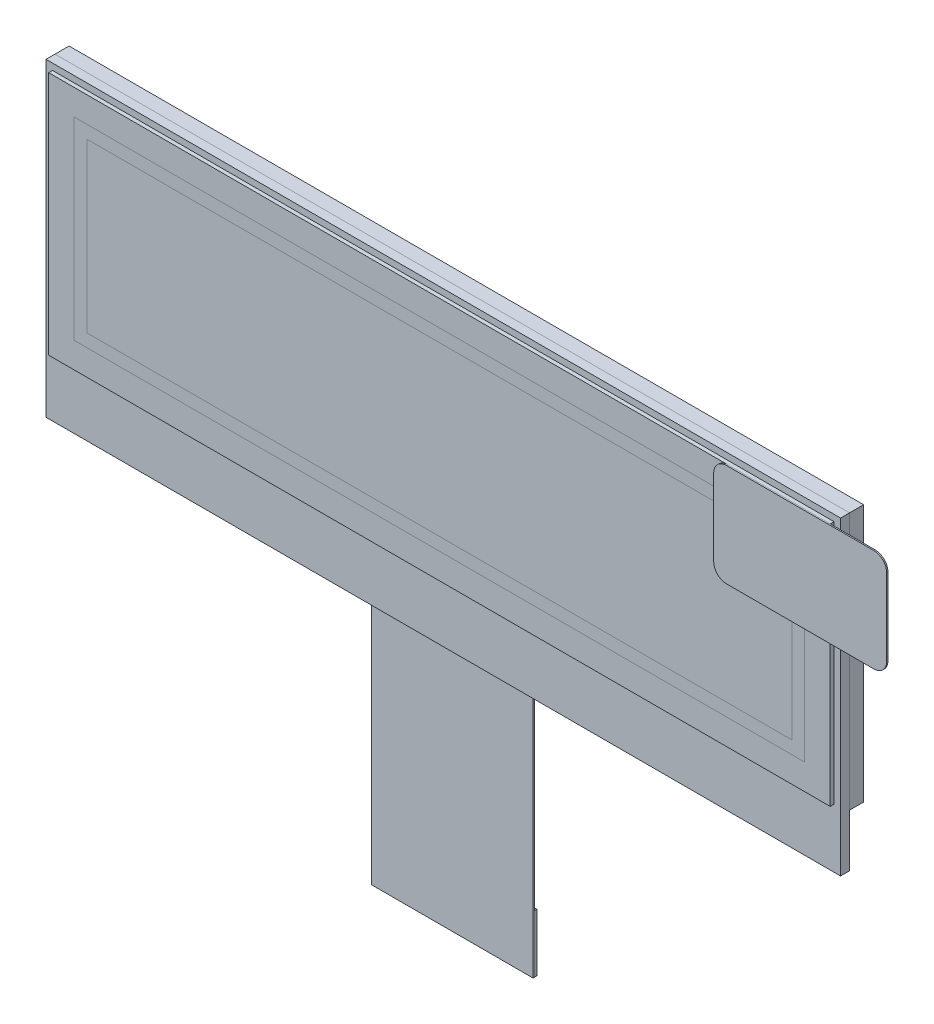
ISO-10303-21;
HEADER;
FILE_DESCRIPTION(('STEP AP214'),'2;1');
FILE_NAME('part.step','',(''),(''),'','','');
FILE_SCHEMA(('AUTOMOTIVE_DESIGN { 1 0 10303 214 1 1 1 1 }'));
ENDSEC;
DATA;
#1=APPLICATION_CONTEXT('core data for automotive mechanical design processes');
#2=APPLICATION_PROTOCOL_DEFINITION('international standard','automotive_design',2000,#1);
#3=PRODUCT_CONTEXT('',#1,'mechanical');
#4=PRODUCT('Part','Part','',(#3));
#5=PRODUCT_RELATED_PRODUCT_CATEGORY('part','',(#4));
#6=PRODUCT_DEFINITION_FORMATION('','',#4);
#7=PRODUCT_DEFINITION_CONTEXT('part definition',#1,'design');
#8=PRODUCT_DEFINITION('design','',#6,#7);
#9=PRODUCT_DEFINITION_SHAPE('','',#8);
#10=(LENGTH_UNIT() NAMED_UNIT(*) SI_UNIT(.MILLI.,.METRE.));
#11=(NAMED_UNIT(*) PLANE_ANGLE_UNIT() SI_UNIT($,.RADIAN.));
#12=(NAMED_UNIT(*) SI_UNIT($,.STERADIAN.) SOLID_ANGLE_UNIT());
#13=UNCERTAINTY_MEASURE_WITH_UNIT(LENGTH_MEASURE(1.E-05),#10,'distance_accuracy_value','');
#14=(GEOMETRIC_REPRESENTATION_CONTEXT(3) GLOBAL_UNCERTAINTY_ASSIGNED_CONTEXT((#13)) GLOBAL_UNIT_ASSIGNED_CONTEXT((#10,
#11,#12)) REPRESENTATION_CONTEXT('',''));
#15=CARTESIAN_POINT('',(0.,0.,0.));
#16=DIRECTION('',(0.,0.,1.));
#17=DIRECTION('',(1.,0.,0.));
#18=AXIS2_PLACEMENT_3D('',#15,#16,#17);
#19=CARTESIAN_POINT('',(6.3,-14.15,0.7));
#20=DIRECTION('',(0.,-1.,0.));
#21=DIRECTION('',(0.,0.,-1.));
#22=AXIS2_PLACEMENT_3D('',#19,#20,#21);
#23=PLANE('',#22);
#24=DIRECTION('',(0.,0.,1.));
#25=VECTOR('',#24,1.);
#26=CARTESIAN_POINT('',(-6.3,-14.15,0.7));
#27=LINE('',#26,#25);
#28=CARTESIAN_POINT('',(-6.3,-14.15,0.));
#29=VERTEX_POINT('',#28);
#30=CARTESIAN_POINT('',(-6.3,-14.15,0.7));
#31=VERTEX_POINT('',#30);
#32=EDGE_CURVE('E12',#29,#31,#27,.T.);
#33=ORIENTED_EDGE('',*,*,#32,.T.);
#34=DIRECTION('',(-1.,0.,0.));
#35=VECTOR('',#34,1.);
#36=CARTESIAN_POINT('',(6.3,-14.15,0.7));
#37=LINE('',#36,#35);
#38=CARTESIAN_POINT('',(6.3,-14.15,0.7));
#39=VERTEX_POINT('',#38);
#40=EDGE_CURVE('E162',#39,#31,#37,.T.);
#41=ORIENTED_EDGE('',*,*,#40,.F.);
#42=DIRECTION('',(0.,0.,1.));
#43=VECTOR('',#42,1.);
#44=CARTESIAN_POINT('',(6.3,-14.15,0.7));
#45=LINE('',#44,#43);
#46=CARTESIAN_POINT('',(6.3,-14.15,0.));
#47=VERTEX_POINT('',#46);
#48=EDGE_CURVE('E68',#47,#39,#45,.T.);
#49=ORIENTED_EDGE('',*,*,#48,.F.);
#50=DIRECTION('',(-1.,0.,0.));
#51=VECTOR('',#50,1.);
#52=CARTESIAN_POINT('',(6.3,-14.15,0.));
#53=LINE('',#52,#51);
#54=EDGE_CURVE('E110',#47,#29,#53,.T.);
#55=ORIENTED_EDGE('',*,*,#54,.T.);
#56=EDGE_LOOP('',(#33,#41,#49,#55));
#57=FACE_BOUND('',#56,.T.);
#58=ADVANCED_FACE('F61',(#57),#23,.F.);
#59=CARTESIAN_POINT('',(6.3,-14.15,0.7));
#60=DIRECTION('',(0.,0.707106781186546,-0.707106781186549));
#61=DIRECTION('',(0.,0.707106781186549,0.707106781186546));
#62=AXIS2_PLACEMENT_3D('',#59,#60,#61);
#63=PLANE('',#62);
#64=DIRECTION('',(0.,-0.707106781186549,-0.707106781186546));
#65=VECTOR('',#64,1.);
#66=CARTESIAN_POINT('',(-6.3,-14.15,0.7));
#67=LINE('',#66,#65);
#68=CARTESIAN_POINT('',(-6.3,-14.85,0.));
#69=VERTEX_POINT('',#68);
#70=EDGE_CURVE('E75',#31,#69,#67,.T.);
#71=ORIENTED_EDGE('',*,*,#70,.T.);
#72=DIRECTION('',(-1.,0.,0.));
#73=VECTOR('',#72,1.);
#74=CARTESIAN_POINT('',(6.3,-14.85,0.));
#75=LINE('',#74,#73);
#76=CARTESIAN_POINT('',(6.3,-14.85,0.));
#77=VERTEX_POINT('',#76);
#78=EDGE_CURVE('E107',#77,#69,#75,.T.);
#79=ORIENTED_EDGE('',*,*,#78,.F.);
#80=DIRECTION('',(0.,-0.707106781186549,-0.707106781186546));
#81=VECTOR('',#80,1.);
#82=CARTESIAN_POINT('',(6.3,-14.15,0.7));
#83=LINE('',#82,#81);
#84=EDGE_CURVE('E98',#39,#77,#83,.T.);
#85=ORIENTED_EDGE('',*,*,#84,.F.);
#86=ORIENTED_EDGE('',*,*,#40,.T.);
#87=EDGE_LOOP('',(#71,#79,#85,#86));
#88=FACE_BOUND('',#87,.T.);
#89=ADVANCED_FACE('F124',(#88),#63,.F.);
#90=CARTESIAN_POINT('',(6.3,-14.15,0.));
#91=DIRECTION('',(0.,0.,1.));
#92=DIRECTION('',(1.,0.,0.));
#93=AXIS2_PLACEMENT_3D('',#90,#91,#92);
#94=PLANE('',#93);
#95=DIRECTION('',(0.,1.,0.));
#96=VECTOR('',#95,1.);
#97=CARTESIAN_POINT('',(-6.3,-14.15,0.));
#98=LINE('',#97,#96);
#99=EDGE_CURVE('E101',#69,#29,#98,.T.);
#100=ORIENTED_EDGE('',*,*,#99,.T.);
#101=ORIENTED_EDGE('',*,*,#54,.F.);
#102=DIRECTION('',(0.,1.,0.));
#103=VECTOR('',#102,1.);
#104=CARTESIAN_POINT('',(6.3,-14.15,0.));
#105=LINE('',#104,#103);
#106=EDGE_CURVE('E114',#77,#47,#105,.T.);
#107=ORIENTED_EDGE('',*,*,#106,.F.);
#108=ORIENTED_EDGE('',*,*,#78,.T.);
#109=EDGE_LOOP('',(#100,#101,#107,#108));
#110=FACE_BOUND('',#109,.T.);
#111=ADVANCED_FACE('F102',(#110),#94,.F.);
#112=CARTESIAN_POINT('',(6.3,0.,0.));
#113=DIRECTION('',(-1.,0.,0.));
#114=DIRECTION('',(0.,0.,1.));
#115=AXIS2_PLACEMENT_3D('',#112,#113,#114);
#116=PLANE('',#115);
#117=ORIENTED_EDGE('',*,*,#48,.T.);
#118=ORIENTED_EDGE('',*,*,#84,.T.);
#119=ORIENTED_EDGE('',*,*,#106,.T.);
#120=EDGE_LOOP('',(#117,#118,#119));
#121=FACE_BOUND('',#120,.T.);
#122=ADVANCED_FACE('F66',(#121),#116,.F.);
#123=CARTESIAN_POINT('',(-6.3,0.,0.));
#124=DIRECTION('',(-1.,0.,0.));
#125=DIRECTION('',(0.,0.,1.));
#126=AXIS2_PLACEMENT_3D('',#123,#124,#125);
#127=PLANE('',#126);
#128=ORIENTED_EDGE('',*,*,#32,.F.);
#129=ORIENTED_EDGE('',*,*,#99,.F.);
#130=ORIENTED_EDGE('',*,*,#70,.F.);
#131=EDGE_LOOP('',(#128,#129,#130));
#132=FACE_BOUND('',#131,.T.);
#133=ADVANCED_FACE('F120',(#132),#127,.T.);
#134=CLOSED_SHELL('',(#58,#89,#111,#122,#133));
#135=MANIFOLD_SOLID_BREP('B2',#134);
#136=CARTESIAN_POINT('',(6.3,-13.15,0.));
#137=DIRECTION('',(0.,0.,-1.));
#138=DIRECTION('',(-1.,0.,0.));
#139=AXIS2_PLACEMENT_3D('',#136,#137,#138);
#140=PLANE('',#139);
#141=DIRECTION('',(-1.,0.,0.));
#142=VECTOR('',#141,1.);
#143=CARTESIAN_POINT('',(6.3,-10.05,0.));
#144=LINE('',#143,#142);
#145=CARTESIAN_POINT('',(10.,-10.05,0.));
#146=VERTEX_POINT('',#145);
#147=CARTESIAN_POINT('',(-10.,-10.05,0.));
#148=VERTEX_POINT('',#147);
#149=EDGE_CURVE('E213',#146,#148,#144,.T.);
#150=ORIENTED_EDGE('',*,*,#149,.T.);
#151=DIRECTION('',(0.,1.,0.));
#152=VECTOR('',#151,1.);
#153=CARTESIAN_POINT('',(-10.,-13.15,0.));
#154=LINE('',#153,#152);
#155=CARTESIAN_POINT('',(-10.,-13.15,0.));
#156=VERTEX_POINT('',#155);
#157=EDGE_CURVE('E262',#156,#148,#154,.T.);
#158=ORIENTED_EDGE('',*,*,#157,.F.);
#159=DIRECTION('',(-1.,0.,0.));
#160=VECTOR('',#159,1.);
#161=CARTESIAN_POINT('',(6.3,-13.15,0.));
#162=LINE('',#161,#160);
#163=CARTESIAN_POINT('',(10.,-13.15,0.));
#164=VERTEX_POINT('',#163);
#165=EDGE_CURVE('E65',#164,#156,#162,.T.);
#166=ORIENTED_EDGE('',*,*,#165,.F.);
#167=DIRECTION('',(0.,1.,0.));
#168=VECTOR('',#167,1.);
#169=CARTESIAN_POINT('',(10.,-13.15,0.));
#170=LINE('',#169,#168);
#171=EDGE_CURVE('E248',#164,#146,#170,.T.);
#172=ORIENTED_EDGE('',*,*,#171,.T.);
#173=EDGE_LOOP('',(#150,#158,#166,#172));
#174=FACE_BOUND('',#173,.T.);
#175=ADVANCED_FACE('F187',(#174),#140,.F.);
#176=CARTESIAN_POINT('',(6.3,-13.15,0.));
#177=DIRECTION('',(0.,1.,0.));
#178=DIRECTION('',(0.,0.,1.));
#179=AXIS2_PLACEMENT_3D('',#176,#177,#178);
#180=PLANE('',#179);
#181=ORIENTED_EDGE('',*,*,#165,.T.);
#182=DIRECTION('',(0.,0.,-1.));
#183=VECTOR('',#182,1.);
#184=CARTESIAN_POINT('',(-10.,-13.15,0.));
#185=LINE('',#184,#183);
#186=CARTESIAN_POINT('',(-10.,-13.15,-0.1));
#187=VERTEX_POINT('',#186);
#188=EDGE_CURVE('E257',#156,#187,#185,.T.);
#189=ORIENTED_EDGE('',*,*,#188,.T.);
#190=DIRECTION('',(-1.,0.,0.));
#191=VECTOR('',#190,1.);
#192=CARTESIAN_POINT('',(6.3,-13.15,-0.1));
#193=LINE('',#192,#191);
#194=CARTESIAN_POINT('',(10.,-13.15,-0.1));
#195=VERTEX_POINT('',#194);
#196=EDGE_CURVE('E193',#195,#187,#193,.T.);
#197=ORIENTED_EDGE('',*,*,#196,.F.);
#198=DIRECTION('',(0.,0.,-1.));
#199=VECTOR('',#198,1.);
#200=CARTESIAN_POINT('',(10.,-13.15,0.));
#201=LINE('',#200,#199);
#202=EDGE_CURVE('E242',#164,#195,#201,.T.);
#203=ORIENTED_EDGE('',*,*,#202,.F.);
#204=EDGE_LOOP('',(#181,#189,#197,#203));
#205=FACE_BOUND('',#204,.T.);
#206=ADVANCED_FACE('F275',(#205),#180,.F.);
#207=CARTESIAN_POINT('',(6.3,-10.05,4.205));
#208=DIRECTION('',(-1.,0.,0.));
#209=DIRECTION('',(0.,0.,1.));
#210=AXIS2_PLACEMENT_3D('',#207,#208,#209);
#211=CYLINDRICAL_SURFACE('',#210,5.305);
#212=ORIENTED_EDGE('',*,*,#196,.T.);
#213=CARTESIAN_POINT('',(-10.,-10.05,4.205));
#214=DIRECTION('',(1.,0.,0.));
#215=DIRECTION('',(0.,0.,-1.));
#216=AXIS2_PLACEMENT_3D('',#213,#214,#215);
#217=CIRCLE('',#216,5.305);
#218=CARTESIAN_POINT('',(-10.,-10.05,-1.1));
#219=VERTEX_POINT('',#218);
#220=EDGE_CURVE('E231',#187,#219,#217,.T.);
#221=ORIENTED_EDGE('',*,*,#220,.T.);
#222=DIRECTION('',(-1.,0.,0.));
#223=VECTOR('',#222,1.);
#224=CARTESIAN_POINT('',(6.3,-10.05,-1.1));
#225=LINE('',#224,#223);
#226=CARTESIAN_POINT('',(10.,-10.05,-1.1));
#227=VERTEX_POINT('',#226);
#228=EDGE_CURVE('E227',#227,#219,#225,.T.);
#229=ORIENTED_EDGE('',*,*,#228,.F.);
#230=CARTESIAN_POINT('',(10.,-10.05,4.205));
#231=DIRECTION('',(1.,0.,0.));
#232=DIRECTION('',(0.,0.,-1.));
#233=AXIS2_PLACEMENT_3D('',#230,#231,#232);
#234=CIRCLE('',#233,5.305);
#235=EDGE_CURVE('E229',#195,#227,#234,.T.);
#236=ORIENTED_EDGE('',*,*,#235,.F.);
#237=EDGE_LOOP('',(#212,#221,#229,#236));
#238=FACE_BOUND('',#237,.T.);
#239=ADVANCED_FACE('F230',(#238),#211,.T.);
#240=CARTESIAN_POINT('',(6.3,-10.05,0.));
#241=DIRECTION('',(0.,-1.,0.));
#242=DIRECTION('',(0.,0.,-1.));
#243=AXIS2_PLACEMENT_3D('',#240,#241,#242);
#244=PLANE('',#243);
#245=ORIENTED_EDGE('',*,*,#228,.T.);
#246=DIRECTION('',(0.,0.,-1.));
#247=VECTOR('',#246,1.);
#248=CARTESIAN_POINT('',(-10.,-10.05,0.));
#249=LINE('',#248,#247);
#250=EDGE_CURVE('E261',#148,#219,#249,.T.);
#251=ORIENTED_EDGE('',*,*,#250,.F.);
#252=ORIENTED_EDGE('',*,*,#149,.F.);
#253=DIRECTION('',(0.,0.,-1.));
#254=VECTOR('',#253,1.);
#255=CARTESIAN_POINT('',(10.,-10.05,0.));
#256=LINE('',#255,#254);
#257=EDGE_CURVE('E243',#146,#227,#256,.T.);
#258=ORIENTED_EDGE('',*,*,#257,.T.);
#259=EDGE_LOOP('',(#245,#251,#252,#258));
#260=FACE_BOUND('',#259,.T.);
#261=ADVANCED_FACE('F250',(#260),#244,.F.);
#262=CARTESIAN_POINT('',(10.,-10.05,4.205));
#263=DIRECTION('',(1.,0.,0.));
#264=DIRECTION('',(0.,0.,-1.));
#265=AXIS2_PLACEMENT_3D('',#262,#263,#264);
#266=PLANE('',#265);
#267=ORIENTED_EDGE('',*,*,#202,.T.);
#268=ORIENTED_EDGE('',*,*,#235,.T.);
#269=ORIENTED_EDGE('',*,*,#257,.F.);
#270=ORIENTED_EDGE('',*,*,#171,.F.);
#271=EDGE_LOOP('',(#267,#268,#269,#270));
#272=FACE_BOUND('',#271,.T.);
#273=ADVANCED_FACE('F241',(#272),#266,.T.);
#274=CARTESIAN_POINT('',(-10.,-10.05,4.205));
#275=DIRECTION('',(1.,0.,0.));
#276=DIRECTION('',(0.,0.,-1.));
#277=AXIS2_PLACEMENT_3D('',#274,#275,#276);
#278=PLANE('',#277);
#279=ORIENTED_EDGE('',*,*,#188,.F.);
#280=ORIENTED_EDGE('',*,*,#157,.T.);
#281=ORIENTED_EDGE('',*,*,#250,.T.);
#282=ORIENTED_EDGE('',*,*,#220,.F.);
#283=EDGE_LOOP('',(#279,#280,#281,#282));
#284=FACE_BOUND('',#283,.T.);
#285=ADVANCED_FACE('F272',(#284),#278,.F.);
#286=CLOSED_SHELL('',(#175,#206,#239,#261,#273,#285));
#287=MANIFOLD_SOLID_BREP('B6',#286);
#288=CARTESIAN_POINT('',(6.29999999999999,-33.75,-0.3));
#289=DIRECTION('',(-1.,0.,0.));
#290=DIRECTION('',(0.,0.,1.));
#291=AXIS2_PLACEMENT_3D('',#288,#289,#290);
#292=PLANE('',#291);
#293=DIRECTION('',(0.,-1.,0.));
#294=VECTOR('',#293,1.);
#295=CARTESIAN_POINT('',(6.29999999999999,-33.75,-0.1));
#296=LINE('',#295,#294);
#297=CARTESIAN_POINT('',(6.29999999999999,-29.25,-0.1));
#298=VERTEX_POINT('',#297);
#299=CARTESIAN_POINT('',(6.29999999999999,-33.75,-0.1));
#300=VERTEX_POINT('',#299);
#301=EDGE_CURVE('E418',#298,#300,#296,.T.);
#302=ORIENTED_EDGE('',*,*,#301,.T.);
#303=DIRECTION('',(0.,0.,1.));
#304=VECTOR('',#303,1.);
#305=CARTESIAN_POINT('',(6.29999999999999,-33.75,-0.3));
#306=LINE('',#305,#304);
#307=CARTESIAN_POINT('',(6.29999999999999,-33.75,-0.3));
#308=VERTEX_POINT('',#307);
#309=EDGE_CURVE('E183',#308,#300,#306,.T.);
#310=ORIENTED_EDGE('',*,*,#309,.F.);
#311=DIRECTION('',(0.,-1.,0.));
#312=VECTOR('',#311,1.);
#313=CARTESIAN_POINT('',(6.29999999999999,-33.75,-0.3));
#314=LINE('',#313,#312);
#315=CARTESIAN_POINT('',(6.29999999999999,-29.25,-0.3));
#316=VERTEX_POINT('',#315);
#317=EDGE_CURVE('E405',#316,#308,#314,.T.);
#318=ORIENTED_EDGE('',*,*,#317,.F.);
#319=DIRECTION('',(0.,0.,1.));
#320=VECTOR('',#319,1.);
#321=CARTESIAN_POINT('',(6.29999999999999,-29.25,-0.3));
#322=LINE('',#321,#320);
#323=EDGE_CURVE('E414',#316,#298,#322,.T.);
#324=ORIENTED_EDGE('',*,*,#323,.T.);
#325=EDGE_LOOP('',(#302,#310,#318,#324));
#326=FACE_BOUND('',#325,.T.);
#327=ADVANCED_FACE('F349',(#326),#292,.F.);
#328=CARTESIAN_POINT('',(6.29999999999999,-33.75,-0.3));
#329=DIRECTION('',(0.,1.,0.));
#330=DIRECTION('',(0.,0.,1.));
#331=AXIS2_PLACEMENT_3D('',#328,#329,#330);
#332=PLANE('',#331);
#333=DIRECTION('',(-1.,0.,0.));
#334=VECTOR('',#333,1.);
#335=CARTESIAN_POINT('',(6.29999999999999,-33.75,-0.1));
#336=LINE('',#335,#334);
#337=CARTESIAN_POINT('',(-6.3,-33.75,-0.1));
#338=VERTEX_POINT('',#337);
#339=EDGE_CURVE('E410',#300,#338,#336,.T.);
#340=ORIENTED_EDGE('',*,*,#339,.T.);
#341=DIRECTION('',(0.,0.,1.));
#342=VECTOR('',#341,1.);
#343=CARTESIAN_POINT('',(-6.3,-33.75,-0.3));
#344=LINE('',#343,#342);
#345=CARTESIAN_POINT('',(-6.3,-33.75,-0.3));
#346=VERTEX_POINT('',#345);
#347=EDGE_CURVE('E360',#346,#338,#344,.T.);
#348=ORIENTED_EDGE('',*,*,#347,.F.);
#349=DIRECTION('',(-1.,0.,0.));
#350=VECTOR('',#349,1.);
#351=CARTESIAN_POINT('',(6.29999999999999,-33.75,-0.3));
#352=LINE('',#351,#350);
#353=EDGE_CURVE('E397',#308,#346,#352,.T.);
#354=ORIENTED_EDGE('',*,*,#353,.F.);
#355=ORIENTED_EDGE('',*,*,#309,.T.);
#356=EDGE_LOOP('',(#340,#348,#354,#355));
#357=FACE_BOUND('',#356,.T.);
#358=ADVANCED_FACE('F407',(#357),#332,.F.);
#359=CARTESIAN_POINT('',(-6.3,-33.75,-0.3));
#360=DIRECTION('',(1.,0.,0.));
#361=DIRECTION('',(0.,0.,-1.));
#362=AXIS2_PLACEMENT_3D('',#359,#360,#361);
#363=PLANE('',#362);
#364=DIRECTION('',(0.,1.,0.));
#365=VECTOR('',#364,1.);
#366=CARTESIAN_POINT('',(-6.3,-33.75,-0.1));
#367=LINE('',#366,#365);
#368=CARTESIAN_POINT('',(-6.3,-29.25,-0.1));
#369=VERTEX_POINT('',#368);
#370=EDGE_CURVE('E381',#338,#369,#367,.T.);
#371=ORIENTED_EDGE('',*,*,#370,.T.);
#372=DIRECTION('',(0.,0.,1.));
#373=VECTOR('',#372,1.);
#374=CARTESIAN_POINT('',(-6.3,-29.25,-0.3));
#375=LINE('',#374,#373);
#376=CARTESIAN_POINT('',(-6.3,-29.25,-0.3));
#377=VERTEX_POINT('',#376);
#378=EDGE_CURVE('E406',#377,#369,#375,.T.);
#379=ORIENTED_EDGE('',*,*,#378,.F.);
#380=DIRECTION('',(0.,1.,0.));
#381=VECTOR('',#380,1.);
#382=CARTESIAN_POINT('',(-6.3,-33.75,-0.3));
#383=LINE('',#382,#381);
#384=EDGE_CURVE('E400',#346,#377,#383,.T.);
#385=ORIENTED_EDGE('',*,*,#384,.F.);
#386=ORIENTED_EDGE('',*,*,#347,.T.);
#387=EDGE_LOOP('',(#371,#379,#385,#386));
#388=FACE_BOUND('',#387,.T.);
#389=ADVANCED_FACE('F408',(#388),#363,.F.);
#390=CARTESIAN_POINT('',(6.29999999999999,-29.25,-0.3));
#391=DIRECTION('',(0.,-1.,0.));
#392=DIRECTION('',(0.,0.,-1.));
#393=AXIS2_PLACEMENT_3D('',#390,#391,#392);
#394=PLANE('',#393);
#395=DIRECTION('',(1.,0.,0.));
#396=VECTOR('',#395,1.);
#397=CARTESIAN_POINT('',(6.29999999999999,-29.25,-0.1));
#398=LINE('',#397,#396);
#399=EDGE_CURVE('E388',#369,#298,#398,.T.);
#400=ORIENTED_EDGE('',*,*,#399,.T.);
#401=ORIENTED_EDGE('',*,*,#323,.F.);
#402=DIRECTION('',(1.,0.,0.));
#403=VECTOR('',#402,1.);
#404=CARTESIAN_POINT('',(6.29999999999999,-29.25,-0.3));
#405=LINE('',#404,#403);
#406=EDGE_CURVE('E370',#377,#316,#405,.T.);
#407=ORIENTED_EDGE('',*,*,#406,.F.);
#408=ORIENTED_EDGE('',*,*,#378,.T.);
#409=EDGE_LOOP('',(#400,#401,#407,#408));
#410=FACE_BOUND('',#409,.T.);
#411=ADVANCED_FACE('F431',(#410),#394,.F.);
#412=CARTESIAN_POINT('',(0.,0.,-0.3));
#413=DIRECTION('',(0.,0.,1.));
#414=DIRECTION('',(1.,0.,0.));
#415=AXIS2_PLACEMENT_3D('',#412,#413,#414);
#416=PLANE('',#415);
#417=ORIENTED_EDGE('',*,*,#317,.T.);
#418=ORIENTED_EDGE('',*,*,#353,.T.);
#419=ORIENTED_EDGE('',*,*,#384,.T.);
#420=ORIENTED_EDGE('',*,*,#406,.T.);
#421=EDGE_LOOP('',(#417,#418,#419,#420));
#422=FACE_BOUND('',#421,.T.);
#423=ADVANCED_FACE('F399',(#422),#416,.F.);
#424=CARTESIAN_POINT('',(0.,0.,-0.1));
#425=DIRECTION('',(0.,0.,1.));
#426=DIRECTION('',(1.,0.,0.));
#427=AXIS2_PLACEMENT_3D('',#424,#425,#426);
#428=PLANE('',#427);
#429=ORIENTED_EDGE('',*,*,#301,.F.);
#430=ORIENTED_EDGE('',*,*,#399,.F.);
#431=ORIENTED_EDGE('',*,*,#370,.F.);
#432=ORIENTED_EDGE('',*,*,#339,.F.);
#433=EDGE_LOOP('',(#429,#430,#431,#432));
#434=FACE_BOUND('',#433,.T.);
#435=ADVANCED_FACE('F432',(#434),#428,.T.);
#436=CLOSED_SHELL('',(#327,#358,#389,#411,#423,#435));
#437=MANIFOLD_SOLID_BREP('B57',#436);
#438=CARTESIAN_POINT('',(34.01,8.55,1.1));
#439=DIRECTION('',(0.,0.,-1.));
#440=DIRECTION('',(-1.,0.,0.));
#441=AXIS2_PLACEMENT_3D('',#438,#439,#440);
#442=CYLINDRICAL_SURFACE('',#441,1.);
#443=CARTESIAN_POINT('',(34.01,8.55,1.));
#444=DIRECTION('',(0.,0.,1.));
#445=DIRECTION('',(-1.,0.,0.));
#446=AXIS2_PLACEMENT_3D('',#443,#444,#445);
#447=CIRCLE('',#446,1.);
#448=CARTESIAN_POINT('',(35.01,8.54999999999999,1.));
#449=VERTEX_POINT('',#448);
#450=CARTESIAN_POINT('',(34.01,9.55,1.));
#451=VERTEX_POINT('',#450);
#452=EDGE_CURVE('E603',#449,#451,#447,.T.);
#453=ORIENTED_EDGE('',*,*,#452,.T.);
#454=DIRECTION('',(0.,0.,-1.));
#455=VECTOR('',#454,1.);
#456=CARTESIAN_POINT('',(34.01,9.55,1.1));
#457=LINE('',#456,#455);
#458=CARTESIAN_POINT('',(34.01,9.55,1.1));
#459=VERTEX_POINT('',#458);
#460=EDGE_CURVE('E348',#459,#451,#457,.T.);
#461=ORIENTED_EDGE('',*,*,#460,.F.);
#462=CARTESIAN_POINT('',(34.01,8.55,1.1));
#463=DIRECTION('',(0.,0.,1.));
#464=DIRECTION('',(-1.,0.,0.));
#465=AXIS2_PLACEMENT_3D('',#462,#463,#464);
#466=CIRCLE('',#465,1.);
#467=CARTESIAN_POINT('',(35.01,8.54999999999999,1.1));
#468=VERTEX_POINT('',#467);
#469=EDGE_CURVE('E626',#468,#459,#466,.T.);
#470=ORIENTED_EDGE('',*,*,#469,.F.);
#471=DIRECTION('',(0.,0.,-1.));
#472=VECTOR('',#471,1.);
#473=CARTESIAN_POINT('',(35.01,8.54999999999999,1.1));
#474=LINE('',#473,#472);
#475=EDGE_CURVE('E602',#468,#449,#474,.T.);
#476=ORIENTED_EDGE('',*,*,#475,.T.);
#477=EDGE_LOOP('',(#453,#461,#470,#476));
#478=FACE_BOUND('',#477,.T.);
#479=ADVANCED_FACE('F505',(#478),#442,.T.);
#480=CARTESIAN_POINT('',(22.508,9.55,1.1));
#481=DIRECTION('',(0.,-1.,0.));
#482=DIRECTION('',(0.,0.,-1.));
#483=AXIS2_PLACEMENT_3D('',#480,#481,#482);
#484=PLANE('',#483);
#485=DIRECTION('',(-1.,0.,0.));
#486=VECTOR('',#485,1.);
#487=CARTESIAN_POINT('',(22.508,9.55,1.));
#488=LINE('',#487,#486);
#489=CARTESIAN_POINT('',(22.508,9.55,1.));
#490=VERTEX_POINT('',#489);
#491=EDGE_CURVE('E607',#451,#490,#488,.T.);
#492=ORIENTED_EDGE('',*,*,#491,.T.);
#493=DIRECTION('',(0.,0.,-1.));
#494=VECTOR('',#493,1.);
#495=CARTESIAN_POINT('',(22.508,9.55,1.1));
#496=LINE('',#495,#494);
#497=CARTESIAN_POINT('',(22.508,9.55,1.1));
#498=VERTEX_POINT('',#497);
#499=EDGE_CURVE('E512',#498,#490,#496,.T.);
#500=ORIENTED_EDGE('',*,*,#499,.F.);
#501=DIRECTION('',(-1.,0.,0.));
#502=VECTOR('',#501,1.);
#503=CARTESIAN_POINT('',(22.508,9.55,1.1));
#504=LINE('',#503,#502);
#505=EDGE_CURVE('E565',#459,#498,#504,.T.);
#506=ORIENTED_EDGE('',*,*,#505,.F.);
#507=ORIENTED_EDGE('',*,*,#460,.T.);
#508=EDGE_LOOP('',(#492,#500,#506,#507));
#509=FACE_BOUND('',#508,.T.);
#510=ADVANCED_FACE('F671',(#509),#484,.F.);
#511=CARTESIAN_POINT('',(22.508,8.55,1.1));
#512=DIRECTION('',(0.,0.,-1.));
#513=DIRECTION('',(-1.,0.,0.));
#514=AXIS2_PLACEMENT_3D('',#511,#512,#513);
#515=CYLINDRICAL_SURFACE('',#514,1.);
#516=CARTESIAN_POINT('',(22.508,8.55,1.));
#517=DIRECTION('',(0.,0.,1.));
#518=DIRECTION('',(1.,0.,0.));
#519=AXIS2_PLACEMENT_3D('',#516,#517,#518);
#520=CIRCLE('',#519,1.);
#521=CARTESIAN_POINT('',(21.508,8.54999999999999,1.));
#522=VERTEX_POINT('',#521);
#523=EDGE_CURVE('E612',#490,#522,#520,.T.);
#524=ORIENTED_EDGE('',*,*,#523,.T.);
#525=DIRECTION('',(0.,0.,-1.));
#526=VECTOR('',#525,1.);
#527=CARTESIAN_POINT('',(21.508,8.54999999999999,1.1));
#528=LINE('',#527,#526);
#529=CARTESIAN_POINT('',(21.508,8.54999999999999,1.1));
#530=VERTEX_POINT('',#529);
#531=EDGE_CURVE('E640',#530,#522,#528,.T.);
#532=ORIENTED_EDGE('',*,*,#531,.F.);
#533=CARTESIAN_POINT('',(22.508,8.55,1.1));
#534=DIRECTION('',(0.,0.,1.));
#535=DIRECTION('',(1.,0.,0.));
#536=AXIS2_PLACEMENT_3D('',#533,#534,#535);
#537=CIRCLE('',#536,1.);
#538=EDGE_CURVE('E650',#498,#530,#537,.T.);
#539=ORIENTED_EDGE('',*,*,#538,.F.);
#540=ORIENTED_EDGE('',*,*,#499,.T.);
#541=EDGE_LOOP('',(#524,#532,#539,#540));
#542=FACE_BOUND('',#541,.T.);
#543=ADVANCED_FACE('F643',(#542),#515,.T.);
#544=CARTESIAN_POINT('',(21.508,8.54999999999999,1.1));
#545=DIRECTION('',(1.,0.,0.));
#546=DIRECTION('',(0.,0.,-1.));
#547=AXIS2_PLACEMENT_3D('',#544,#545,#546);
#548=PLANE('',#547);
#549=DIRECTION('',(0.,-1.,0.));
#550=VECTOR('',#549,1.);
#551=CARTESIAN_POINT('',(21.508,8.54999999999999,1.));
#552=LINE('',#551,#550);
#553=CARTESIAN_POINT('',(21.508,2.54800000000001,1.));
#554=VERTEX_POINT('',#553);
#555=EDGE_CURVE('E615',#522,#554,#552,.T.);
#556=ORIENTED_EDGE('',*,*,#555,.T.);
#557=DIRECTION('',(0.,0.,-1.));
#558=VECTOR('',#557,1.);
#559=CARTESIAN_POINT('',(21.508,2.54800000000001,1.1));
#560=LINE('',#559,#558);
#561=CARTESIAN_POINT('',(21.508,2.54800000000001,1.1));
#562=VERTEX_POINT('',#561);
#563=EDGE_CURVE('E633',#562,#554,#560,.T.);
#564=ORIENTED_EDGE('',*,*,#563,.F.);
#565=DIRECTION('',(0.,-1.,0.));
#566=VECTOR('',#565,1.);
#567=CARTESIAN_POINT('',(21.508,8.54999999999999,1.1));
#568=LINE('',#567,#566);
#569=EDGE_CURVE('E660',#530,#562,#568,.T.);
#570=ORIENTED_EDGE('',*,*,#569,.F.);
#571=ORIENTED_EDGE('',*,*,#531,.T.);
#572=EDGE_LOOP('',(#556,#564,#570,#571));
#573=FACE_BOUND('',#572,.T.);
#574=ADVANCED_FACE('F654',(#573),#548,.F.);
#575=CARTESIAN_POINT('',(22.508,2.548,1.1));
#576=DIRECTION('',(0.,0.,-1.));
#577=DIRECTION('',(-1.,0.,0.));
#578=AXIS2_PLACEMENT_3D('',#575,#576,#577);
#579=CYLINDRICAL_SURFACE('',#578,1.);
#580=CARTESIAN_POINT('',(22.508,2.548,1.));
#581=DIRECTION('',(0.,0.,1.));
#582=DIRECTION('',(1.,0.,0.));
#583=AXIS2_PLACEMENT_3D('',#580,#581,#582);
#584=CIRCLE('',#583,1.);
#585=CARTESIAN_POINT('',(22.508,1.548,1.));
#586=VERTEX_POINT('',#585);
#587=EDGE_CURVE('E616',#554,#586,#584,.T.);
#588=ORIENTED_EDGE('',*,*,#587,.T.);
#589=DIRECTION('',(0.,0.,-1.));
#590=VECTOR('',#589,1.);
#591=CARTESIAN_POINT('',(22.508,1.548,1.1));
#592=LINE('',#591,#590);
#593=CARTESIAN_POINT('',(22.508,1.548,1.1));
#594=VERTEX_POINT('',#593);
#595=EDGE_CURVE('E592',#594,#586,#592,.T.);
#596=ORIENTED_EDGE('',*,*,#595,.F.);
#597=CARTESIAN_POINT('',(22.508,2.548,1.1));
#598=DIRECTION('',(0.,0.,1.));
#599=DIRECTION('',(1.,0.,0.));
#600=AXIS2_PLACEMENT_3D('',#597,#598,#599);
#601=CIRCLE('',#600,1.);
#602=EDGE_CURVE('E582',#562,#594,#601,.T.);
#603=ORIENTED_EDGE('',*,*,#602,.F.);
#604=ORIENTED_EDGE('',*,*,#563,.T.);
#605=EDGE_LOOP('',(#588,#596,#603,#604));
#606=FACE_BOUND('',#605,.T.);
#607=ADVANCED_FACE('F659',(#606),#579,.T.);
#608=CARTESIAN_POINT('',(22.508,1.548,1.1));
#609=DIRECTION('',(0.,1.,0.));
#610=DIRECTION('',(0.,0.,1.));
#611=AXIS2_PLACEMENT_3D('',#608,#609,#610);
#612=PLANE('',#611);
#613=DIRECTION('',(1.,0.,0.));
#614=VECTOR('',#613,1.);
#615=CARTESIAN_POINT('',(22.508,1.548,1.));
#616=LINE('',#615,#614);
#617=CARTESIAN_POINT('',(34.01,1.548,1.));
#618=VERTEX_POINT('',#617);
#619=EDGE_CURVE('E589',#586,#618,#616,.T.);
#620=ORIENTED_EDGE('',*,*,#619,.T.);
#621=DIRECTION('',(0.,0.,-1.));
#622=VECTOR('',#621,1.);
#623=CARTESIAN_POINT('',(34.01,1.548,1.1));
#624=LINE('',#623,#622);
#625=CARTESIAN_POINT('',(34.01,1.548,1.1));
#626=VERTEX_POINT('',#625);
#627=EDGE_CURVE('E590',#626,#618,#624,.T.);
#628=ORIENTED_EDGE('',*,*,#627,.F.);
#629=DIRECTION('',(1.,0.,0.));
#630=VECTOR('',#629,1.);
#631=CARTESIAN_POINT('',(22.508,1.548,1.1));
#632=LINE('',#631,#630);
#633=EDGE_CURVE('E574',#594,#626,#632,.T.);
#634=ORIENTED_EDGE('',*,*,#633,.F.);
#635=ORIENTED_EDGE('',*,*,#595,.T.);
#636=EDGE_LOOP('',(#620,#628,#634,#635));
#637=FACE_BOUND('',#636,.T.);
#638=ADVANCED_FACE('F588',(#637),#612,.F.);
#639=CARTESIAN_POINT('',(34.01,2.548,1.1));
#640=DIRECTION('',(0.,0.,-1.));
#641=DIRECTION('',(-1.,0.,0.));
#642=AXIS2_PLACEMENT_3D('',#639,#640,#641);
#643=CYLINDRICAL_SURFACE('',#642,1.);
#644=CARTESIAN_POINT('',(34.01,2.548,1.));
#645=DIRECTION('',(0.,0.,1.));
#646=DIRECTION('',(1.,0.,0.));
#647=AXIS2_PLACEMENT_3D('',#644,#645,#646);
#648=CIRCLE('',#647,1.);
#649=CARTESIAN_POINT('',(35.01,2.548,1.));
#650=VERTEX_POINT('',#649);
#651=EDGE_CURVE('E549',#618,#650,#648,.T.);
#652=ORIENTED_EDGE('',*,*,#651,.T.);
#653=DIRECTION('',(0.,0.,-1.));
#654=VECTOR('',#653,1.);
#655=CARTESIAN_POINT('',(35.01,2.548,1.1));
#656=LINE('',#655,#654);
#657=CARTESIAN_POINT('',(35.01,2.548,1.1));
#658=VERTEX_POINT('',#657);
#659=EDGE_CURVE('E594',#658,#650,#656,.T.);
#660=ORIENTED_EDGE('',*,*,#659,.F.);
#661=CARTESIAN_POINT('',(34.01,2.548,1.1));
#662=DIRECTION('',(0.,0.,1.));
#663=DIRECTION('',(1.,0.,0.));
#664=AXIS2_PLACEMENT_3D('',#661,#662,#663);
#665=CIRCLE('',#664,1.);
#666=EDGE_CURVE('E576',#626,#658,#665,.T.);
#667=ORIENTED_EDGE('',*,*,#666,.F.);
#668=ORIENTED_EDGE('',*,*,#627,.T.);
#669=EDGE_LOOP('',(#652,#660,#667,#668));
#670=FACE_BOUND('',#669,.T.);
#671=ADVANCED_FACE('F595',(#670),#643,.T.);
#672=CARTESIAN_POINT('',(35.01,8.54999999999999,1.1));
#673=DIRECTION('',(-1.,0.,0.));
#674=DIRECTION('',(0.,0.,1.));
#675=AXIS2_PLACEMENT_3D('',#672,#673,#674);
#676=PLANE('',#675);
#677=DIRECTION('',(0.,1.,0.));
#678=VECTOR('',#677,1.);
#679=CARTESIAN_POINT('',(35.01,8.54999999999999,1.));
#680=LINE('',#679,#678);
#681=EDGE_CURVE('E555',#650,#449,#680,.T.);
#682=ORIENTED_EDGE('',*,*,#681,.T.);
#683=ORIENTED_EDGE('',*,*,#475,.F.);
#684=DIRECTION('',(0.,1.,0.));
#685=VECTOR('',#684,1.);
#686=CARTESIAN_POINT('',(35.01,8.54999999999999,1.1));
#687=LINE('',#686,#685);
#688=EDGE_CURVE('E516',#658,#468,#687,.T.);
#689=ORIENTED_EDGE('',*,*,#688,.F.);
#690=ORIENTED_EDGE('',*,*,#659,.T.);
#691=EDGE_LOOP('',(#682,#683,#689,#690));
#692=FACE_BOUND('',#691,.T.);
#693=ADVANCED_FACE('F688',(#692),#676,.F.);
#694=CARTESIAN_POINT('',(34.01,8.55,1.1));
#695=DIRECTION('',(0.,0.,-1.));
#696=DIRECTION('',(-1.,0.,0.));
#697=AXIS2_PLACEMENT_3D('',#694,#695,#696);
#698=PLANE('',#697);
#699=ORIENTED_EDGE('',*,*,#469,.T.);
#700=ORIENTED_EDGE('',*,*,#505,.T.);
#701=ORIENTED_EDGE('',*,*,#538,.T.);
#702=ORIENTED_EDGE('',*,*,#569,.T.);
#703=ORIENTED_EDGE('',*,*,#602,.T.);
#704=ORIENTED_EDGE('',*,*,#633,.T.);
#705=ORIENTED_EDGE('',*,*,#666,.T.);
#706=ORIENTED_EDGE('',*,*,#688,.T.);
#707=EDGE_LOOP('',(#699,#700,#701,#702,#703,#704,#705,#706));
#708=FACE_BOUND('',#707,.T.);
#709=ADVANCED_FACE('F580',(#708),#698,.F.);
#710=CARTESIAN_POINT('',(34.01,8.55,1.));
#711=DIRECTION('',(0.,0.,-1.));
#712=DIRECTION('',(-1.,0.,0.));
#713=AXIS2_PLACEMENT_3D('',#710,#711,#712);
#714=PLANE('',#713);
#715=ORIENTED_EDGE('',*,*,#452,.F.);
#716=ORIENTED_EDGE('',*,*,#681,.F.);
#717=ORIENTED_EDGE('',*,*,#651,.F.);
#718=ORIENTED_EDGE('',*,*,#619,.F.);
#719=ORIENTED_EDGE('',*,*,#587,.F.);
#720=ORIENTED_EDGE('',*,*,#555,.F.);
#721=ORIENTED_EDGE('',*,*,#523,.F.);
#722=ORIENTED_EDGE('',*,*,#491,.F.);
#723=EDGE_LOOP('',(#715,#716,#717,#718,#719,#720,#721,#722));
#724=FACE_BOUND('',#723,.T.);
#725=ADVANCED_FACE('F651',(#724),#714,.T.);
#726=CLOSED_SHELL('',(#479,#510,#543,#574,#607,#638,#671,#693,#709,#725));
#727=MANIFOLD_SOLID_BREP('B178',#726);
#728=CARTESIAN_POINT('',(0.,0.,1.));
#729=DIRECTION('',(0.,0.,1.));
#730=DIRECTION('',(1.,0.,0.));
#731=AXIS2_PLACEMENT_3D('',#728,#729,#730);
#732=PLANE('',#731);
#733=DIRECTION('',(0.,1.,0.));
#734=VECTOR('',#733,1.);
#735=CARTESIAN_POINT('',(-28.51,0.,1.));
#736=LINE('',#735,#734);
#737=CARTESIAN_POINT('',(-28.51,-7.55,1.));
#738=VERTEX_POINT('',#737);
#739=CARTESIAN_POINT('',(-28.51,7.55,1.));
#740=VERTEX_POINT('',#739);
#741=EDGE_CURVE('E905',#738,#740,#736,.T.);
#742=ORIENTED_EDGE('',*,*,#741,.F.);
#743=DIRECTION('',(-1.,0.,0.));
#744=VECTOR('',#743,1.);
#745=CARTESIAN_POINT('',(0.,-7.55,1.));
#746=LINE('',#745,#744);
#747=CARTESIAN_POINT('',(28.51,-7.55,1.));
#748=VERTEX_POINT('',#747);
#749=EDGE_CURVE('E897',#748,#738,#746,.T.);
#750=ORIENTED_EDGE('',*,*,#749,.F.);
#751=DIRECTION('',(0.,-1.,0.));
#752=VECTOR('',#751,1.);
#753=CARTESIAN_POINT('',(28.51,0.,1.));
#754=LINE('',#753,#752);
#755=CARTESIAN_POINT('',(28.51,7.55,1.));
#756=VERTEX_POINT('',#755);
#757=EDGE_CURVE('E892',#756,#748,#754,.T.);
#758=ORIENTED_EDGE('',*,*,#757,.F.);
#759=DIRECTION('',(1.,0.,0.));
#760=VECTOR('',#759,1.);
#761=CARTESIAN_POINT('',(0.,7.55,1.));
#762=LINE('',#761,#760);
#763=EDGE_CURVE('E882',#740,#756,#762,.T.);
#764=ORIENTED_EDGE('',*,*,#763,.F.);
#765=EDGE_LOOP('',(#742,#750,#758,#764));
#766=FACE_BOUND('',#765,.T.);
#767=DIRECTION('',(-1.,0.,0.));
#768=VECTOR('',#767,1.);
#769=CARTESIAN_POINT('',(0.,-6.548,1.));
#770=LINE('',#769,#768);
#771=CARTESIAN_POINT('',(27.508,-6.548,1.));
#772=VERTEX_POINT('',#771);
#773=CARTESIAN_POINT('',(-27.508,-6.548,1.));
#774=VERTEX_POINT('',#773);
#775=EDGE_CURVE('E783',#772,#774,#770,.T.);
#776=ORIENTED_EDGE('',*,*,#775,.T.);
#777=DIRECTION('',(0.,1.,0.));
#778=VECTOR('',#777,1.);
#779=CARTESIAN_POINT('',(-27.508,0.,1.));
#780=LINE('',#779,#778);
#781=CARTESIAN_POINT('',(-27.508,6.548,1.));
#782=VERTEX_POINT('',#781);
#783=EDGE_CURVE('E499',#774,#782,#780,.T.);
#784=ORIENTED_EDGE('',*,*,#783,.T.);
#785=DIRECTION('',(1.,0.,0.));
#786=VECTOR('',#785,1.);
#787=CARTESIAN_POINT('',(0.,6.548,1.));
#788=LINE('',#787,#786);
#789=CARTESIAN_POINT('',(27.508,6.548,1.));
#790=VERTEX_POINT('',#789);
#791=EDGE_CURVE('E903',#782,#790,#788,.T.);
#792=ORIENTED_EDGE('',*,*,#791,.T.);
#793=DIRECTION('',(0.,-1.,0.));
#794=VECTOR('',#793,1.);
#795=CARTESIAN_POINT('',(27.508,0.,1.));
#796=LINE('',#795,#794);
#797=EDGE_CURVE('E906',#790,#772,#796,.T.);
#798=ORIENTED_EDGE('',*,*,#797,.T.);
#799=EDGE_LOOP('',(#776,#784,#792,#798));
#800=FACE_BOUND('',#799,.T.);
#801=ADVANCED_FACE('F771',(#766,#800),#732,.T.);
#802=DIRECTION('',(0.,1.,0.));
#803=VECTOR('',#802,1.);
#804=CARTESIAN_POINT('',(-30.5,0.,1.));
#805=LINE('',#804,#803);
#806=CARTESIAN_POINT('',(-30.5,-9.55000000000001,1.));
#807=VERTEX_POINT('',#806);
#808=CARTESIAN_POINT('',(-30.5,9.55,1.));
#809=VERTEX_POINT('',#808);
#810=EDGE_CURVE('E842',#807,#809,#805,.T.);
#811=ORIENTED_EDGE('',*,*,#810,.F.);
#812=DIRECTION('',(-1.,0.,0.));
#813=VECTOR('',#812,1.);
#814=CARTESIAN_POINT('',(0.,-9.55000000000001,1.));
#815=LINE('',#814,#813);
#816=CARTESIAN_POINT('',(30.5,-9.55000000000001,1.));
#817=VERTEX_POINT('',#816);
#818=EDGE_CURVE('E858',#817,#807,#815,.T.);
#819=ORIENTED_EDGE('',*,*,#818,.F.);
#820=DIRECTION('',(0.,1.,0.));
#821=VECTOR('',#820,1.);
#822=CARTESIAN_POINT('',(30.5,0.,1.));
#823=LINE('',#822,#821);
#824=CARTESIAN_POINT('',(30.5,9.55,1.));
#825=VERTEX_POINT('',#824);
#826=EDGE_CURVE('E841',#817,#825,#823,.T.);
#827=ORIENTED_EDGE('',*,*,#826,.T.);
#828=DIRECTION('',(-1.,0.,0.));
#829=VECTOR('',#828,1.);
#830=CARTESIAN_POINT('',(0.,9.55,1.));
#831=LINE('',#830,#829);
#832=EDGE_CURVE('E834',#825,#809,#831,.T.);
#833=ORIENTED_EDGE('',*,*,#832,.T.);
#834=EDGE_LOOP('',(#811,#819,#827,#833));
#835=FACE_BOUND('',#834,.T.);
#836=ORIENTED_EDGE('',*,*,#749,.T.);
#837=ORIENTED_EDGE('',*,*,#741,.T.);
#838=ORIENTED_EDGE('',*,*,#763,.T.);
#839=ORIENTED_EDGE('',*,*,#757,.T.);
#840=EDGE_LOOP('',(#836,#837,#838,#839));
#841=FACE_BOUND('',#840,.T.);
#842=ADVANCED_FACE('F840',(#835,#841),#732,.T.);
#843=CARTESIAN_POINT('',(-30.5,0.,1.));
#844=DIRECTION('',(-1.,0.,0.));
#845=DIRECTION('',(0.,0.,1.));
#846=AXIS2_PLACEMENT_3D('',#843,#844,#845);
#847=PLANE('',#846);
#848=DIRECTION('',(0.,1.,0.));
#849=VECTOR('',#848,1.);
#850=CARTESIAN_POINT('',(-30.5,0.,0.7));
#851=LINE('',#850,#849);
#852=CARTESIAN_POINT('',(-30.5,-9.55000000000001,0.7));
#853=VERTEX_POINT('',#852);
#854=CARTESIAN_POINT('',(-30.5,9.55,0.7));
#855=VERTEX_POINT('',#854);
#856=EDGE_CURVE('E877',#853,#855,#851,.T.);
#857=ORIENTED_EDGE('',*,*,#856,.F.);
#858=DIRECTION('',(0.,0.,-1.));
#859=VECTOR('',#858,1.);
#860=CARTESIAN_POINT('',(-30.5,-9.55000000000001,1.));
#861=LINE('',#860,#859);
#862=EDGE_CURVE('E865',#807,#853,#861,.T.);
#863=ORIENTED_EDGE('',*,*,#862,.F.);
#864=ORIENTED_EDGE('',*,*,#810,.T.);
#865=DIRECTION('',(0.,0.,-1.));
#866=VECTOR('',#865,1.);
#867=CARTESIAN_POINT('',(-30.5,9.55,1.));
#868=LINE('',#867,#866);
#869=EDGE_CURVE('E851',#809,#855,#868,.T.);
#870=ORIENTED_EDGE('',*,*,#869,.T.);
#871=EDGE_LOOP('',(#857,#863,#864,#870));
#872=FACE_BOUND('',#871,.T.);
#873=ADVANCED_FACE('F777',(#872),#847,.T.);
#874=CARTESIAN_POINT('',(0.,-9.55000000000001,1.));
#875=DIRECTION('',(0.,-1.,0.));
#876=DIRECTION('',(0.,0.,-1.));
#877=AXIS2_PLACEMENT_3D('',#874,#875,#876);
#878=PLANE('',#877);
#879=DIRECTION('',(-1.,0.,0.));
#880=VECTOR('',#879,1.);
#881=CARTESIAN_POINT('',(0.,-9.55000000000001,0.7));
#882=LINE('',#881,#880);
#883=CARTESIAN_POINT('',(30.5,-9.55000000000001,0.7));
#884=VERTEX_POINT('',#883);
#885=EDGE_CURVE('E861',#884,#853,#882,.T.);
#886=ORIENTED_EDGE('',*,*,#885,.F.);
#887=DIRECTION('',(0.,0.,-1.));
#888=VECTOR('',#887,1.);
#889=CARTESIAN_POINT('',(30.5,-9.55000000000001,1.));
#890=LINE('',#889,#888);
#891=EDGE_CURVE('E886',#817,#884,#890,.T.);
#892=ORIENTED_EDGE('',*,*,#891,.F.);
#893=ORIENTED_EDGE('',*,*,#818,.T.);
#894=ORIENTED_EDGE('',*,*,#862,.T.);
#895=EDGE_LOOP('',(#886,#892,#893,#894));
#896=FACE_BOUND('',#895,.T.);
#897=ADVANCED_FACE('F926',(#896),#878,.T.);
#898=CARTESIAN_POINT('',(30.5,0.,1.));
#899=DIRECTION('',(-1.,0.,0.));
#900=DIRECTION('',(0.,0.,1.));
#901=AXIS2_PLACEMENT_3D('',#898,#899,#900);
#902=PLANE('',#901);
#903=DIRECTION('',(0.,1.,0.));
#904=VECTOR('',#903,1.);
#905=CARTESIAN_POINT('',(30.5,0.,0.7));
#906=LINE('',#905,#904);
#907=CARTESIAN_POINT('',(30.5,9.55,0.7));
#908=VERTEX_POINT('',#907);
#909=EDGE_CURVE('E869',#884,#908,#906,.T.);
#910=ORIENTED_EDGE('',*,*,#909,.T.);
#911=DIRECTION('',(0.,0.,-1.));
#912=VECTOR('',#911,1.);
#913=CARTESIAN_POINT('',(30.5,9.55,1.));
#914=LINE('',#913,#912);
#915=EDGE_CURVE('E859',#825,#908,#914,.T.);
#916=ORIENTED_EDGE('',*,*,#915,.F.);
#917=ORIENTED_EDGE('',*,*,#826,.F.);
#918=ORIENTED_EDGE('',*,*,#891,.T.);
#919=EDGE_LOOP('',(#910,#916,#917,#918));
#920=FACE_BOUND('',#919,.T.);
#921=ADVANCED_FACE('F921',(#920),#902,.F.);
#922=CARTESIAN_POINT('',(0.,9.55,1.));
#923=DIRECTION('',(0.,-1.,0.));
#924=DIRECTION('',(0.,0.,-1.));
#925=AXIS2_PLACEMENT_3D('',#922,#923,#924);
#926=PLANE('',#925);
#927=DIRECTION('',(-1.,0.,0.));
#928=VECTOR('',#927,1.);
#929=CARTESIAN_POINT('',(0.,9.55,0.7));
#930=LINE('',#929,#928);
#931=EDGE_CURVE('E853',#908,#855,#930,.T.);
#932=ORIENTED_EDGE('',*,*,#931,.T.);
#933=ORIENTED_EDGE('',*,*,#869,.F.);
#934=ORIENTED_EDGE('',*,*,#832,.F.);
#935=ORIENTED_EDGE('',*,*,#915,.T.);
#936=EDGE_LOOP('',(#932,#933,#934,#935));
#937=FACE_BOUND('',#936,.T.);
#938=ADVANCED_FACE('F852',(#937),#926,.F.);
#939=ORIENTED_EDGE('',*,*,#783,.F.);
#940=ORIENTED_EDGE('',*,*,#775,.F.);
#941=ORIENTED_EDGE('',*,*,#797,.F.);
#942=ORIENTED_EDGE('',*,*,#791,.F.);
#943=EDGE_LOOP('',(#939,#940,#941,#942));
#944=FACE_BOUND('',#943,.T.);
#945=ADVANCED_FACE('F913',(#944),#732,.T.);
#946=CARTESIAN_POINT('',(0.,0.,0.7));
#947=DIRECTION('',(0.,0.,1.));
#948=DIRECTION('',(1.,0.,0.));
#949=AXIS2_PLACEMENT_3D('',#946,#947,#948);
#950=PLANE('',#949);
#951=ORIENTED_EDGE('',*,*,#856,.T.);
#952=ORIENTED_EDGE('',*,*,#931,.F.);
#953=ORIENTED_EDGE('',*,*,#909,.F.);
#954=ORIENTED_EDGE('',*,*,#885,.T.);
#955=EDGE_LOOP('',(#951,#952,#953,#954));
#956=FACE_BOUND('',#955,.T.);
#957=ADVANCED_FACE('F914',(#956),#950,.F.);
#958=CLOSED_SHELL('',(#801,#842,#873,#897,#921,#938,#945,#957));
#959=MANIFOLD_SOLID_BREP('B345',#958);
#960=CARTESIAN_POINT('',(-30.5,0.,-1.25));
#961=DIRECTION('',(-1.,0.,0.));
#962=DIRECTION('',(0.,0.,1.));
#963=AXIS2_PLACEMENT_3D('',#960,#961,#962);
#964=PLANE('',#963);
#965=DIRECTION('',(0.,-1.,0.));
#966=VECTOR('',#965,1.);
#967=CARTESIAN_POINT('',(-30.5,0.,-1.1));
#968=LINE('',#967,#966);
#969=CARTESIAN_POINT('',(-30.5,9.55,-1.1));
#970=VERTEX_POINT('',#969);
#971=CARTESIAN_POINT('',(-30.5,-9.55000000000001,-1.1));
#972=VERTEX_POINT('',#971);
#973=EDGE_CURVE('E1111',#970,#972,#968,.T.);
#974=ORIENTED_EDGE('',*,*,#973,.F.);
#975=DIRECTION('',(0.,0.,1.));
#976=VECTOR('',#975,1.);
#977=CARTESIAN_POINT('',(-30.5,9.55,-1.25));
#978=LINE('',#977,#976);
#979=CARTESIAN_POINT('',(-30.5,9.55,-1.25));
#980=VERTEX_POINT('',#979);
#981=EDGE_CURVE('E775',#980,#970,#978,.T.);
#982=ORIENTED_EDGE('',*,*,#981,.F.);
#983=DIRECTION('',(0.,-1.,0.));
#984=VECTOR('',#983,1.);
#985=CARTESIAN_POINT('',(-30.5,0.,-1.25));
#986=LINE('',#985,#984);
#987=CARTESIAN_POINT('',(-30.5,-9.55000000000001,-1.25));
#988=VERTEX_POINT('',#987);
#989=EDGE_CURVE('E1101',#980,#988,#986,.T.);
#990=ORIENTED_EDGE('',*,*,#989,.T.);
#991=DIRECTION('',(0.,0.,1.));
#992=VECTOR('',#991,1.);
#993=CARTESIAN_POINT('',(-30.5,-9.55000000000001,-1.25));
#994=LINE('',#993,#992);
#995=EDGE_CURVE('E1043',#988,#972,#994,.T.);
#996=ORIENTED_EDGE('',*,*,#995,.T.);
#997=EDGE_LOOP('',(#974,#982,#990,#996));
#998=FACE_BOUND('',#997,.T.);
#999=ADVANCED_FACE('F1038',(#998),#964,.T.);
#1000=CARTESIAN_POINT('',(0.,9.55,-1.25));
#1001=DIRECTION('',(0.,-1.,0.));
#1002=DIRECTION('',(0.,0.,-1.));
#1003=AXIS2_PLACEMENT_3D('',#1000,#1001,#1002);
#1004=PLANE('',#1003);
#1005=DIRECTION('',(1.,0.,0.));
#1006=VECTOR('',#1005,1.);
#1007=CARTESIAN_POINT('',(0.,9.55,-1.1));
#1008=LINE('',#1007,#1006);
#1009=CARTESIAN_POINT('',(30.5,9.55,-1.1));
#1010=VERTEX_POINT('',#1009);
#1011=EDGE_CURVE('E1075',#970,#1010,#1008,.T.);
#1012=ORIENTED_EDGE('',*,*,#1011,.T.);
#1013=DIRECTION('',(0.,0.,1.));
#1014=VECTOR('',#1013,1.);
#1015=CARTESIAN_POINT('',(30.5,9.55,-1.25));
#1016=LINE('',#1015,#1014);
#1017=CARTESIAN_POINT('',(30.5,9.55,-1.25));
#1018=VERTEX_POINT('',#1017);
#1019=EDGE_CURVE('E1050',#1018,#1010,#1016,.T.);
#1020=ORIENTED_EDGE('',*,*,#1019,.F.);
#1021=DIRECTION('',(1.,0.,0.));
#1022=VECTOR('',#1021,1.);
#1023=CARTESIAN_POINT('',(0.,9.55,-1.25));
#1024=LINE('',#1023,#1022);
#1025=EDGE_CURVE('E1091',#980,#1018,#1024,.T.);
#1026=ORIENTED_EDGE('',*,*,#1025,.F.);
#1027=ORIENTED_EDGE('',*,*,#981,.T.);
#1028=EDGE_LOOP('',(#1012,#1020,#1026,#1027));
#1029=FACE_BOUND('',#1028,.T.);
#1030=ADVANCED_FACE('F1130',(#1029),#1004,.F.);
#1031=CARTESIAN_POINT('',(30.5,0.,-1.25));
#1032=DIRECTION('',(-1.,0.,0.));
#1033=DIRECTION('',(0.,0.,1.));
#1034=AXIS2_PLACEMENT_3D('',#1031,#1032,#1033);
#1035=PLANE('',#1034);
#1036=DIRECTION('',(0.,-1.,0.));
#1037=VECTOR('',#1036,1.);
#1038=CARTESIAN_POINT('',(30.5,0.,-1.1));
#1039=LINE('',#1038,#1037);
#1040=CARTESIAN_POINT('',(30.5,-9.55000000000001,-1.1));
#1041=VERTEX_POINT('',#1040);
#1042=EDGE_CURVE('E1096',#1010,#1041,#1039,.T.);
#1043=ORIENTED_EDGE('',*,*,#1042,.T.);
#1044=DIRECTION('',(0.,0.,1.));
#1045=VECTOR('',#1044,1.);
#1046=CARTESIAN_POINT('',(30.5,-9.55000000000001,-1.25));
#1047=LINE('',#1046,#1045);
#1048=CARTESIAN_POINT('',(30.5,-9.55000000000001,-1.25));
#1049=VERTEX_POINT('',#1048);
#1050=EDGE_CURVE('E1097',#1049,#1041,#1047,.T.);
#1051=ORIENTED_EDGE('',*,*,#1050,.F.);
#1052=DIRECTION('',(0.,-1.,0.));
#1053=VECTOR('',#1052,1.);
#1054=CARTESIAN_POINT('',(30.5,0.,-1.25));
#1055=LINE('',#1054,#1053);
#1056=EDGE_CURVE('E1086',#1018,#1049,#1055,.T.);
#1057=ORIENTED_EDGE('',*,*,#1056,.F.);
#1058=ORIENTED_EDGE('',*,*,#1019,.T.);
#1059=EDGE_LOOP('',(#1043,#1051,#1057,#1058));
#1060=FACE_BOUND('',#1059,.T.);
#1061=ADVANCED_FACE('F1100',(#1060),#1035,.F.);
#1062=CARTESIAN_POINT('',(0.,-9.55000000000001,-1.25));
#1063=DIRECTION('',(0.,-1.,0.));
#1064=DIRECTION('',(0.,0.,-1.));
#1065=AXIS2_PLACEMENT_3D('',#1062,#1063,#1064);
#1066=PLANE('',#1065);
#1067=DIRECTION('',(1.,0.,0.));
#1068=VECTOR('',#1067,1.);
#1069=CARTESIAN_POINT('',(0.,-9.55000000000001,-1.1));
#1070=LINE('',#1069,#1068);
#1071=EDGE_CURVE('E1115',#972,#1041,#1070,.T.);
#1072=ORIENTED_EDGE('',*,*,#1071,.F.);
#1073=ORIENTED_EDGE('',*,*,#995,.F.);
#1074=DIRECTION('',(1.,0.,0.));
#1075=VECTOR('',#1074,1.);
#1076=CARTESIAN_POINT('',(0.,-9.55000000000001,-1.25));
#1077=LINE('',#1076,#1075);
#1078=EDGE_CURVE('E1089',#988,#1049,#1077,.T.);
#1079=ORIENTED_EDGE('',*,*,#1078,.T.);
#1080=ORIENTED_EDGE('',*,*,#1050,.T.);
#1081=EDGE_LOOP('',(#1072,#1073,#1079,#1080));
#1082=FACE_BOUND('',#1081,.T.);
#1083=ADVANCED_FACE('F1105',(#1082),#1066,.T.);
#1084=CARTESIAN_POINT('',(0.,0.,-1.25));
#1085=DIRECTION('',(0.,0.,1.));
#1086=DIRECTION('',(1.,0.,0.));
#1087=AXIS2_PLACEMENT_3D('',#1084,#1085,#1086);
#1088=PLANE('',#1087);
#1089=ORIENTED_EDGE('',*,*,#989,.F.);
#1090=ORIENTED_EDGE('',*,*,#1025,.T.);
#1091=ORIENTED_EDGE('',*,*,#1056,.T.);
#1092=ORIENTED_EDGE('',*,*,#1078,.F.);
#1093=EDGE_LOOP('',(#1089,#1090,#1091,#1092));
#1094=FACE_BOUND('',#1093,.T.);
#1095=ADVANCED_FACE('F1087',(#1094),#1088,.F.);
#1096=CARTESIAN_POINT('',(0.,0.,-1.1));
#1097=DIRECTION('',(0.,0.,1.));
#1098=DIRECTION('',(1.,0.,0.));
#1099=AXIS2_PLACEMENT_3D('',#1096,#1097,#1098);
#1100=PLANE('',#1099);
#1101=ORIENTED_EDGE('',*,*,#973,.T.);
#1102=ORIENTED_EDGE('',*,*,#1071,.T.);
#1103=ORIENTED_EDGE('',*,*,#1042,.F.);
#1104=ORIENTED_EDGE('',*,*,#1011,.F.);
#1105=EDGE_LOOP('',(#1101,#1102,#1103,#1104));
#1106=FACE_BOUND('',#1105,.T.);
#1107=ADVANCED_FACE('F1121',(#1106),#1100,.T.);
#1108=CLOSED_SHELL('',(#999,#1030,#1061,#1083,#1095,#1107));
#1109=MANIFOLD_SOLID_BREP('B494',#1108);
#1110=CARTESIAN_POINT('',(31.01,0.,-1.1));
#1111=DIRECTION('',(-1.,0.,0.));
#1112=DIRECTION('',(0.,-1.,0.));
#1113=AXIS2_PLACEMENT_3D('',#1110,#1111,#1112);
#1114=PLANE('',#1113);
#1115=DIRECTION('',(0.,-1.,0.));
#1116=VECTOR('',#1115,1.);
#1117=CARTESIAN_POINT('',(31.01,0.,0.));
#1118=LINE('',#1117,#1116);
#1119=CARTESIAN_POINT('',(31.01,10.05,0.));
#1120=VERTEX_POINT('',#1119);
#1121=CARTESIAN_POINT('',(31.01,-10.05,0.));
#1122=VERTEX_POINT('',#1121);
#1123=EDGE_CURVE('E1257',#1120,#1122,#1118,.T.);
#1124=ORIENTED_EDGE('',*,*,#1123,.T.);
#1125=DIRECTION('',(0.,0.,1.));
#1126=VECTOR('',#1125,1.);
#1127=CARTESIAN_POINT('',(31.01,-10.05,-1.1));
#1128=LINE('',#1127,#1126);
#1129=CARTESIAN_POINT('',(31.01,-10.05,-1.1));
#1130=VERTEX_POINT('',#1129);
#1131=EDGE_CURVE('E1039',#1130,#1122,#1128,.T.);
#1132=ORIENTED_EDGE('',*,*,#1131,.F.);
#1133=DIRECTION('',(0.,-1.,0.));
#1134=VECTOR('',#1133,1.);
#1135=CARTESIAN_POINT('',(31.01,0.,-1.1));
#1136=LINE('',#1135,#1134);
#1137=CARTESIAN_POINT('',(31.01,10.05,-1.1));
#1138=VERTEX_POINT('',#1137);
#1139=EDGE_CURVE('E1207',#1138,#1130,#1136,.T.);
#1140=ORIENTED_EDGE('',*,*,#1139,.F.);
#1141=DIRECTION('',(0.,0.,1.));
#1142=VECTOR('',#1141,1.);
#1143=CARTESIAN_POINT('',(31.01,10.05,-1.1));
#1144=LINE('',#1143,#1142);
#1145=EDGE_CURVE('E1192',#1138,#1120,#1144,.T.);
#1146=ORIENTED_EDGE('',*,*,#1145,.T.);
#1147=EDGE_LOOP('',(#1124,#1132,#1140,#1146));
#1148=FACE_BOUND('',#1147,.T.);
#1149=ADVANCED_FACE('F1191',(#1148),#1114,.F.);
#1150=CARTESIAN_POINT('',(0.,-10.05,-1.1));
#1151=DIRECTION('',(0.,-1.,0.));
#1152=DIRECTION('',(0.,0.,-1.));
#1153=AXIS2_PLACEMENT_3D('',#1150,#1151,#1152);
#1154=PLANE('',#1153);
#1155=DIRECTION('',(1.,0.,0.));
#1156=VECTOR('',#1155,1.);
#1157=CARTESIAN_POINT('',(0.,-10.05,0.));
#1158=LINE('',#1157,#1156);
#1159=CARTESIAN_POINT('',(-31.01,-10.05,0.));
#1160=VERTEX_POINT('',#1159);
#1161=EDGE_CURVE('E1268',#1160,#1122,#1158,.T.);
#1162=ORIENTED_EDGE('',*,*,#1161,.F.);
#1163=DIRECTION('',(0.,0.,1.));
#1164=VECTOR('',#1163,1.);
#1165=CARTESIAN_POINT('',(-31.01,-10.05,-1.1));
#1166=LINE('',#1165,#1164);
#1167=CARTESIAN_POINT('',(-31.01,-10.05,-1.1));
#1168=VERTEX_POINT('',#1167);
#1169=EDGE_CURVE('E1203',#1168,#1160,#1166,.T.);
#1170=ORIENTED_EDGE('',*,*,#1169,.F.);
#1171=DIRECTION('',(1.,0.,0.));
#1172=VECTOR('',#1171,1.);
#1173=CARTESIAN_POINT('',(0.,-10.05,-1.1));
#1174=LINE('',#1173,#1172);
#1175=EDGE_CURVE('E1252',#1168,#1130,#1174,.T.);
#1176=ORIENTED_EDGE('',*,*,#1175,.T.);
#1177=ORIENTED_EDGE('',*,*,#1131,.T.);
#1178=EDGE_LOOP('',(#1162,#1170,#1176,#1177));
#1179=FACE_BOUND('',#1178,.T.);
#1180=ADVANCED_FACE('F1280',(#1179),#1154,.T.);
#1181=CARTESIAN_POINT('',(-31.01,0.,-1.1));
#1182=DIRECTION('',(-1.,0.,0.));
#1183=DIRECTION('',(0.,-1.,0.));
#1184=AXIS2_PLACEMENT_3D('',#1181,#1182,#1183);
#1185=PLANE('',#1184);
#1186=DIRECTION('',(0.,-1.,0.));
#1187=VECTOR('',#1186,1.);
#1188=CARTESIAN_POINT('',(-31.01,0.,0.));
#1189=LINE('',#1188,#1187);
#1190=CARTESIAN_POINT('',(-31.01,10.05,0.));
#1191=VERTEX_POINT('',#1190);
#1192=EDGE_CURVE('E1242',#1191,#1160,#1189,.T.);
#1193=ORIENTED_EDGE('',*,*,#1192,.F.);
#1194=DIRECTION('',(0.,0.,1.));
#1195=VECTOR('',#1194,1.);
#1196=CARTESIAN_POINT('',(-31.01,10.05,-1.1));
#1197=LINE('',#1196,#1195);
#1198=CARTESIAN_POINT('',(-31.01,10.05,-1.1));
#1199=VERTEX_POINT('',#1198);
#1200=EDGE_CURVE('E1237',#1199,#1191,#1197,.T.);
#1201=ORIENTED_EDGE('',*,*,#1200,.F.);
#1202=DIRECTION('',(0.,-1.,0.));
#1203=VECTOR('',#1202,1.);
#1204=CARTESIAN_POINT('',(-31.01,0.,-1.1));
#1205=LINE('',#1204,#1203);
#1206=EDGE_CURVE('E1241',#1199,#1168,#1205,.T.);
#1207=ORIENTED_EDGE('',*,*,#1206,.T.);
#1208=ORIENTED_EDGE('',*,*,#1169,.T.);
#1209=EDGE_LOOP('',(#1193,#1201,#1207,#1208));
#1210=FACE_BOUND('',#1209,.T.);
#1211=ADVANCED_FACE('F1239',(#1210),#1185,.T.);
#1212=CARTESIAN_POINT('',(0.,10.05,-1.1));
#1213=DIRECTION('',(0.,-1.,0.));
#1214=DIRECTION('',(0.,0.,-1.));
#1215=AXIS2_PLACEMENT_3D('',#1212,#1213,#1214);
#1216=PLANE('',#1215);
#1217=DIRECTION('',(1.,0.,0.));
#1218=VECTOR('',#1217,1.);
#1219=CARTESIAN_POINT('',(0.,10.05,0.));
#1220=LINE('',#1219,#1218);
#1221=EDGE_CURVE('E1262',#1191,#1120,#1220,.T.);
#1222=ORIENTED_EDGE('',*,*,#1221,.T.);
#1223=ORIENTED_EDGE('',*,*,#1145,.F.);
#1224=DIRECTION('',(1.,0.,0.));
#1225=VECTOR('',#1224,1.);
#1226=CARTESIAN_POINT('',(0.,10.05,-1.1));
#1227=LINE('',#1226,#1225);
#1228=EDGE_CURVE('E1236',#1199,#1138,#1227,.T.);
#1229=ORIENTED_EDGE('',*,*,#1228,.F.);
#1230=ORIENTED_EDGE('',*,*,#1200,.T.);
#1231=EDGE_LOOP('',(#1222,#1223,#1229,#1230));
#1232=FACE_BOUND('',#1231,.T.);
#1233=ADVANCED_FACE('F1247',(#1232),#1216,.F.);
#1234=CARTESIAN_POINT('',(0.,0.,-1.1));
#1235=DIRECTION('',(0.,0.,1.));
#1236=DIRECTION('',(1.,0.,0.));
#1237=AXIS2_PLACEMENT_3D('',#1234,#1235,#1236);
#1238=PLANE('',#1237);
#1239=ORIENTED_EDGE('',*,*,#1139,.T.);
#1240=ORIENTED_EDGE('',*,*,#1175,.F.);
#1241=ORIENTED_EDGE('',*,*,#1206,.F.);
#1242=ORIENTED_EDGE('',*,*,#1228,.T.);
#1243=EDGE_LOOP('',(#1239,#1240,#1241,#1242));
#1244=FACE_BOUND('',#1243,.T.);
#1245=ADVANCED_FACE('F1248',(#1244),#1238,.F.);
#1246=CARTESIAN_POINT('',(0.,0.,0.));
#1247=DIRECTION('',(0.,0.,1.));
#1248=DIRECTION('',(1.,0.,0.));
#1249=AXIS2_PLACEMENT_3D('',#1246,#1247,#1248);
#1250=PLANE('',#1249);
#1251=ORIENTED_EDGE('',*,*,#1123,.F.);
#1252=ORIENTED_EDGE('',*,*,#1221,.F.);
#1253=ORIENTED_EDGE('',*,*,#1192,.T.);
#1254=ORIENTED_EDGE('',*,*,#1161,.T.);
#1255=EDGE_LOOP('',(#1251,#1252,#1253,#1254));
#1256=FACE_BOUND('',#1255,.T.);
#1257=ADVANCED_FACE('F1276',(#1256),#1250,.T.);
#1258=CLOSED_SHELL('',(#1149,#1180,#1211,#1233,#1245,#1257));
#1259=MANIFOLD_SOLID_BREP('B766',#1258);
#1260=CARTESIAN_POINT('',(0.,0.,0.));
#1261=DIRECTION('',(0.,0.,1.));
#1262=DIRECTION('',(1.,0.,0.));
#1263=AXIS2_PLACEMENT_3D('',#1260,#1261,#1262);
#1264=PLANE('',#1263);
#1265=DIRECTION('',(0.,-1.,0.));
#1266=VECTOR('',#1265,1.);
#1267=CARTESIAN_POINT('',(6.3,-13.15,0.));
#1268=LINE('',#1267,#1266);
#1269=CARTESIAN_POINT('',(6.3,-13.15,0.));
#1270=VERTEX_POINT('',#1269);
#1271=CARTESIAN_POINT('',(6.3,-14.15,0.));
#1272=VERTEX_POINT('',#1271);
#1273=EDGE_CURVE('E1351',#1270,#1272,#1268,.T.);
#1274=ORIENTED_EDGE('',*,*,#1273,.F.);
#1275=DIRECTION('',(1.,0.,0.));
#1276=VECTOR('',#1275,1.);
#1277=CARTESIAN_POINT('',(-6.3,-13.15,0.));
#1278=LINE('',#1277,#1276);
#1279=CARTESIAN_POINT('',(-6.3,-13.15,0.));
#1280=VERTEX_POINT('',#1279);
#1281=EDGE_CURVE('E1430',#1280,#1270,#1278,.T.);
#1282=ORIENTED_EDGE('',*,*,#1281,.F.);
#1283=DIRECTION('',(0.,1.,0.));
#1284=VECTOR('',#1283,1.);
#1285=CARTESIAN_POINT('',(-6.3,-13.15,0.));
#1286=LINE('',#1285,#1284);
#1287=CARTESIAN_POINT('',(-6.3,-14.15,0.));
#1288=VERTEX_POINT('',#1287);
#1289=EDGE_CURVE('E1186',#1288,#1280,#1286,.T.);
#1290=ORIENTED_EDGE('',*,*,#1289,.F.);
#1291=DIRECTION('',(1.,0.,0.));
#1292=VECTOR('',#1291,1.);
#1293=CARTESIAN_POINT('',(0.,-14.15,0.));
#1294=LINE('',#1293,#1292);
#1295=CARTESIAN_POINT('',(-31.01,-14.15,0.));
#1296=VERTEX_POINT('',#1295);
#1297=EDGE_CURVE('E1440',#1296,#1288,#1294,.T.);
#1298=ORIENTED_EDGE('',*,*,#1297,.F.);
#1299=DIRECTION('',(0.,-1.,0.));
#1300=VECTOR('',#1299,1.);
#1301=CARTESIAN_POINT('',(-31.0099999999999,1.04963463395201E-13,0.));
#1302=LINE('',#1301,#1300);
#1303=CARTESIAN_POINT('',(-31.01,10.05,0.));
#1304=VERTEX_POINT('',#1303);
#1305=EDGE_CURVE('E1448',#1304,#1296,#1302,.T.);
#1306=ORIENTED_EDGE('',*,*,#1305,.F.);
#1307=DIRECTION('',(1.,0.,0.));
#1308=VECTOR('',#1307,1.);
#1309=CARTESIAN_POINT('',(0.,10.05,0.));
#1310=LINE('',#1309,#1308);
#1311=CARTESIAN_POINT('',(31.01,10.05,0.));
#1312=VERTEX_POINT('',#1311);
#1313=EDGE_CURVE('E1468',#1304,#1312,#1310,.T.);
#1314=ORIENTED_EDGE('',*,*,#1313,.T.);
#1315=DIRECTION('',(0.,1.,0.));
#1316=VECTOR('',#1315,1.);
#1317=CARTESIAN_POINT('',(31.0100000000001,-1.31204329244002E-13,0.));
#1318=LINE('',#1317,#1316);
#1319=CARTESIAN_POINT('',(31.01,-14.15,0.));
#1320=VERTEX_POINT('',#1319);
#1321=EDGE_CURVE('E1462',#1320,#1312,#1318,.T.);
#1322=ORIENTED_EDGE('',*,*,#1321,.F.);
#1323=EDGE_CURVE('E1357',#1272,#1320,#1294,.T.);
#1324=ORIENTED_EDGE('',*,*,#1323,.F.);
#1325=EDGE_LOOP('',(#1274,#1282,#1290,#1298,#1306,#1314,#1322,#1324));
#1326=FACE_BOUND('',#1325,.T.);
#1327=ADVANCED_FACE('F1331',(#1326),#1264,.F.);
#1328=CARTESIAN_POINT('',(0.,-14.15,0.7));
#1329=DIRECTION('',(0.,1.,0.));
#1330=DIRECTION('',(-1.,0.,0.));
#1331=AXIS2_PLACEMENT_3D('',#1328,#1329,#1330);
#1332=PLANE('',#1331);
#1333=ORIENTED_EDGE('',*,*,#1297,.T.);
#1334=EDGE_CURVE('E1439',#1288,#1272,#1294,.T.);
#1335=ORIENTED_EDGE('',*,*,#1334,.T.);
#1336=ORIENTED_EDGE('',*,*,#1323,.T.);
#1337=DIRECTION('',(0.,0.,-1.));
#1338=VECTOR('',#1337,1.);
#1339=CARTESIAN_POINT('',(31.01,-14.15,0.7));
#1340=LINE('',#1339,#1338);
#1341=CARTESIAN_POINT('',(31.01,-14.15,0.7));
#1342=VERTEX_POINT('',#1341);
#1343=EDGE_CURVE('E1340',#1342,#1320,#1340,.T.);
#1344=ORIENTED_EDGE('',*,*,#1343,.F.);
#1345=DIRECTION('',(1.,0.,0.));
#1346=VECTOR('',#1345,1.);
#1347=CARTESIAN_POINT('',(0.,-14.15,0.7));
#1348=LINE('',#1347,#1346);
#1349=CARTESIAN_POINT('',(-31.01,-14.15,0.7));
#1350=VERTEX_POINT('',#1349);
#1351=EDGE_CURVE('E1447',#1350,#1342,#1348,.T.);
#1352=ORIENTED_EDGE('',*,*,#1351,.F.);
#1353=DIRECTION('',(0.,0.,-1.));
#1354=VECTOR('',#1353,1.);
#1355=CARTESIAN_POINT('',(-31.01,-14.15,0.7));
#1356=LINE('',#1355,#1354);
#1357=EDGE_CURVE('E1459',#1350,#1296,#1356,.T.);
#1358=ORIENTED_EDGE('',*,*,#1357,.T.);
#1359=EDGE_LOOP('',(#1333,#1335,#1336,#1344,#1352,#1358));
#1360=FACE_BOUND('',#1359,.T.);
#1361=ADVANCED_FACE('F1334',(#1360),#1332,.F.);
#1362=CARTESIAN_POINT('',(31.0100000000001,-1.31204329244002E-13,0.7));
#1363=DIRECTION('',(-1.,0.,0.));
#1364=DIRECTION('',(0.,-1.,0.));
#1365=AXIS2_PLACEMENT_3D('',#1362,#1363,#1364);
#1366=PLANE('',#1365);
#1367=ORIENTED_EDGE('',*,*,#1321,.T.);
#1368=DIRECTION('',(0.,0.,-1.));
#1369=VECTOR('',#1368,1.);
#1370=CARTESIAN_POINT('',(31.01,10.05,0.7));
#1371=LINE('',#1370,#1369);
#1372=CARTESIAN_POINT('',(31.01,10.05,0.7));
#1373=VERTEX_POINT('',#1372);
#1374=EDGE_CURVE('E1480',#1373,#1312,#1371,.T.);
#1375=ORIENTED_EDGE('',*,*,#1374,.F.);
#1376=DIRECTION('',(0.,1.,0.));
#1377=VECTOR('',#1376,1.);
#1378=CARTESIAN_POINT('',(31.0100000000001,-1.31204329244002E-13,0.7));
#1379=LINE('',#1378,#1377);
#1380=EDGE_CURVE('E1446',#1342,#1373,#1379,.T.);
#1381=ORIENTED_EDGE('',*,*,#1380,.F.);
#1382=ORIENTED_EDGE('',*,*,#1343,.T.);
#1383=EDGE_LOOP('',(#1367,#1375,#1381,#1382));
#1384=FACE_BOUND('',#1383,.T.);
#1385=ADVANCED_FACE('F1490',(#1384),#1366,.F.);
#1386=CARTESIAN_POINT('',(0.,10.05,0.7));
#1387=DIRECTION('',(0.,1.,0.));
#1388=DIRECTION('',(0.,0.,1.));
#1389=AXIS2_PLACEMENT_3D('',#1386,#1387,#1388);
#1390=PLANE('',#1389);
#1391=ORIENTED_EDGE('',*,*,#1313,.F.);
#1392=DIRECTION('',(0.,0.,-1.));
#1393=VECTOR('',#1392,1.);
#1394=CARTESIAN_POINT('',(-31.01,10.05,0.7));
#1395=LINE('',#1394,#1393);
#1396=CARTESIAN_POINT('',(-31.01,10.05,0.7));
#1397=VERTEX_POINT('',#1396);
#1398=EDGE_CURVE('E1474',#1397,#1304,#1395,.T.);
#1399=ORIENTED_EDGE('',*,*,#1398,.F.);
#1400=DIRECTION('',(1.,0.,0.));
#1401=VECTOR('',#1400,1.);
#1402=CARTESIAN_POINT('',(0.,10.05,0.7));
#1403=LINE('',#1402,#1401);
#1404=EDGE_CURVE('E1455',#1397,#1373,#1403,.T.);
#1405=ORIENTED_EDGE('',*,*,#1404,.T.);
#1406=ORIENTED_EDGE('',*,*,#1374,.T.);
#1407=EDGE_LOOP('',(#1391,#1399,#1405,#1406));
#1408=FACE_BOUND('',#1407,.T.);
#1409=ADVANCED_FACE('F1494',(#1408),#1390,.T.);
#1410=CARTESIAN_POINT('',(-31.0099999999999,1.04963463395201E-13,0.7));
#1411=DIRECTION('',(1.,0.,0.));
#1412=DIRECTION('',(0.,1.,0.));
#1413=AXIS2_PLACEMENT_3D('',#1410,#1411,#1412);
#1414=PLANE('',#1413);
#1415=ORIENTED_EDGE('',*,*,#1305,.T.);
#1416=ORIENTED_EDGE('',*,*,#1357,.F.);
#1417=DIRECTION('',(0.,-1.,0.));
#1418=VECTOR('',#1417,1.);
#1419=CARTESIAN_POINT('',(-31.0099999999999,1.04963463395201E-13,0.7));
#1420=LINE('',#1419,#1418);
#1421=EDGE_CURVE('E1456',#1397,#1350,#1420,.T.);
#1422=ORIENTED_EDGE('',*,*,#1421,.F.);
#1423=ORIENTED_EDGE('',*,*,#1398,.T.);
#1424=EDGE_LOOP('',(#1415,#1416,#1422,#1423));
#1425=FACE_BOUND('',#1424,.T.);
#1426=ADVANCED_FACE('F1498',(#1425),#1414,.F.);
#1427=CARTESIAN_POINT('',(0.,0.,0.7));
#1428=DIRECTION('',(0.,0.,1.));
#1429=DIRECTION('',(1.,0.,0.));
#1430=AXIS2_PLACEMENT_3D('',#1427,#1428,#1429);
#1431=PLANE('',#1430);
#1432=ORIENTED_EDGE('',*,*,#1351,.T.);
#1433=ORIENTED_EDGE('',*,*,#1380,.T.);
#1434=ORIENTED_EDGE('',*,*,#1404,.F.);
#1435=ORIENTED_EDGE('',*,*,#1421,.T.);
#1436=EDGE_LOOP('',(#1432,#1433,#1434,#1435));
#1437=FACE_BOUND('',#1436,.T.);
#1438=ADVANCED_FACE('F1499',(#1437),#1431,.T.);
#1439=CARTESIAN_POINT('',(0.,0.,0.));
#1440=DIRECTION('',(0.,0.,1.));
#1441=DIRECTION('',(1.,0.,0.));
#1442=AXIS2_PLACEMENT_3D('',#1439,#1440,#1441);
#1443=PLANE('',#1442);
#1444=ORIENTED_EDGE('',*,*,#1334,.F.);
#1445=CARTESIAN_POINT('',(-6.30000000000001,-33.75,0.));
#1446=VERTEX_POINT('',#1445);
#1447=EDGE_CURVE('E1342',#1446,#1288,#1286,.T.);
#1448=ORIENTED_EDGE('',*,*,#1447,.F.);
#1449=DIRECTION('',(-1.,0.,0.));
#1450=VECTOR('',#1449,1.);
#1451=CARTESIAN_POINT('',(-6.30000000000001,-33.75,0.));
#1452=LINE('',#1451,#1450);
#1453=CARTESIAN_POINT('',(6.29999999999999,-33.75,0.));
#1454=VERTEX_POINT('',#1453);
#1455=EDGE_CURVE('E1683',#1454,#1446,#1452,.T.);
#1456=ORIENTED_EDGE('',*,*,#1455,.F.);
#1457=EDGE_CURVE('E1431',#1272,#1454,#1268,.T.);
#1458=ORIENTED_EDGE('',*,*,#1457,.F.);
#1459=EDGE_LOOP('',(#1444,#1448,#1456,#1458));
#1460=FACE_BOUND('',#1459,.T.);
#1461=ADVANCED_FACE('F1502',(#1460),#1443,.T.);
#1462=CARTESIAN_POINT('',(6.3,-13.15,-0.1));
#1463=DIRECTION('',(-1.,0.,0.));
#1464=DIRECTION('',(0.,-1.,0.));
#1465=AXIS2_PLACEMENT_3D('',#1462,#1463,#1464);
#1466=PLANE('',#1465);
#1467=ORIENTED_EDGE('',*,*,#1273,.T.);
#1468=ORIENTED_EDGE('',*,*,#1457,.T.);
#1469=DIRECTION('',(0.,0.,1.));
#1470=VECTOR('',#1469,1.);
#1471=CARTESIAN_POINT('',(6.29999999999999,-33.75,-0.1));
#1472=LINE('',#1471,#1470);
#1473=CARTESIAN_POINT('',(6.29999999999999,-33.75,-0.1));
#1474=VERTEX_POINT('',#1473);
#1475=EDGE_CURVE('E1409',#1474,#1454,#1472,.T.);
#1476=ORIENTED_EDGE('',*,*,#1475,.F.);
#1477=DIRECTION('',(0.,-1.,0.));
#1478=VECTOR('',#1477,1.);
#1479=CARTESIAN_POINT('',(6.3,-13.15,-0.1));
#1480=LINE('',#1479,#1478);
#1481=CARTESIAN_POINT('',(6.3,-13.15,-0.1));
#1482=VERTEX_POINT('',#1481);
#1483=EDGE_CURVE('E1420',#1482,#1474,#1480,.T.);
#1484=ORIENTED_EDGE('',*,*,#1483,.F.);
#1485=DIRECTION('',(0.,0.,1.));
#1486=VECTOR('',#1485,1.);
#1487=CARTESIAN_POINT('',(6.3,-13.15,-0.1));
#1488=LINE('',#1487,#1486);
#1489=EDGE_CURVE('E1672',#1482,#1270,#1488,.T.);
#1490=ORIENTED_EDGE('',*,*,#1489,.T.);
#1491=EDGE_LOOP('',(#1467,#1468,#1476,#1484,#1490));
#1492=FACE_BOUND('',#1491,.T.);
#1493=ADVANCED_FACE('F1426',(#1492),#1466,.F.);
#1494=CARTESIAN_POINT('',(-6.30000000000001,-33.75,-0.1));
#1495=DIRECTION('',(0.,1.,0.));
#1496=DIRECTION('',(0.,0.,1.));
#1497=AXIS2_PLACEMENT_3D('',#1494,#1495,#1496);
#1498=PLANE('',#1497);
#1499=ORIENTED_EDGE('',*,*,#1455,.T.);
#1500=DIRECTION('',(0.,0.,1.));
#1501=VECTOR('',#1500,1.);
#1502=CARTESIAN_POINT('',(-6.30000000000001,-33.75,-0.1));
#1503=LINE('',#1502,#1501);
#1504=CARTESIAN_POINT('',(-6.30000000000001,-33.75,-0.1));
#1505=VERTEX_POINT('',#1504);
#1506=EDGE_CURVE('E1415',#1505,#1446,#1503,.T.);
#1507=ORIENTED_EDGE('',*,*,#1506,.F.);
#1508=DIRECTION('',(-1.,0.,0.));
#1509=VECTOR('',#1508,1.);
#1510=CARTESIAN_POINT('',(-6.30000000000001,-33.75,-0.1));
#1511=LINE('',#1510,#1509);
#1512=EDGE_CURVE('E1406',#1474,#1505,#1511,.T.);
#1513=ORIENTED_EDGE('',*,*,#1512,.F.);
#1514=ORIENTED_EDGE('',*,*,#1475,.T.);
#1515=EDGE_LOOP('',(#1499,#1507,#1513,#1514));
#1516=FACE_BOUND('',#1515,.T.);
#1517=ADVANCED_FACE('F1408',(#1516),#1498,.F.);
#1518=CARTESIAN_POINT('',(-6.3,-13.15,-0.1));
#1519=DIRECTION('',(1.,0.,0.));
#1520=DIRECTION('',(0.,1.,0.));
#1521=AXIS2_PLACEMENT_3D('',#1518,#1519,#1520);
#1522=PLANE('',#1521);
#1523=ORIENTED_EDGE('',*,*,#1447,.T.);
#1524=ORIENTED_EDGE('',*,*,#1289,.T.);
#1525=DIRECTION('',(0.,0.,1.));
#1526=VECTOR('',#1525,1.);
#1527=CARTESIAN_POINT('',(-6.3,-13.15,-0.1));
#1528=LINE('',#1527,#1526);
#1529=CARTESIAN_POINT('',(-6.3,-13.15,-0.1));
#1530=VERTEX_POINT('',#1529);
#1531=EDGE_CURVE('E1445',#1530,#1280,#1528,.T.);
#1532=ORIENTED_EDGE('',*,*,#1531,.F.);
#1533=DIRECTION('',(0.,1.,0.));
#1534=VECTOR('',#1533,1.);
#1535=CARTESIAN_POINT('',(-6.3,-13.15,-0.1));
#1536=LINE('',#1535,#1534);
#1537=EDGE_CURVE('E1416',#1505,#1530,#1536,.T.);
#1538=ORIENTED_EDGE('',*,*,#1537,.F.);
#1539=ORIENTED_EDGE('',*,*,#1506,.T.);
#1540=EDGE_LOOP('',(#1523,#1524,#1532,#1538,#1539));
#1541=FACE_BOUND('',#1540,.T.);
#1542=ADVANCED_FACE('F1551',(#1541),#1522,.F.);
#1543=CARTESIAN_POINT('',(-6.3,-13.15,-0.1));
#1544=DIRECTION('',(0.,-1.,0.));
#1545=DIRECTION('',(1.,0.,0.));
#1546=AXIS2_PLACEMENT_3D('',#1543,#1544,#1545);
#1547=PLANE('',#1546);
#1548=ORIENTED_EDGE('',*,*,#1281,.T.);
#1549=ORIENTED_EDGE('',*,*,#1489,.F.);
#1550=DIRECTION('',(1.,0.,0.));
#1551=VECTOR('',#1550,1.);
#1552=CARTESIAN_POINT('',(-6.3,-13.15,-0.1));
#1553=LINE('',#1552,#1551);
#1554=EDGE_CURVE('E1425',#1530,#1482,#1553,.T.);
#1555=ORIENTED_EDGE('',*,*,#1554,.F.);
#1556=ORIENTED_EDGE('',*,*,#1531,.T.);
#1557=EDGE_LOOP('',(#1548,#1549,#1555,#1556));
#1558=FACE_BOUND('',#1557,.T.);
#1559=ADVANCED_FACE('F1565',(#1558),#1547,.F.);
#1560=CARTESIAN_POINT('',(0.,0.,-0.1));
#1561=DIRECTION('',(0.,0.,1.));
#1562=DIRECTION('',(1.,0.,0.));
#1563=AXIS2_PLACEMENT_3D('',#1560,#1561,#1562);
#1564=PLANE('',#1563);
#1565=ORIENTED_EDGE('',*,*,#1483,.T.);
#1566=ORIENTED_EDGE('',*,*,#1512,.T.);
#1567=ORIENTED_EDGE('',*,*,#1537,.T.);
#1568=ORIENTED_EDGE('',*,*,#1554,.T.);
#1569=EDGE_LOOP('',(#1565,#1566,#1567,#1568));
#1570=FACE_BOUND('',#1569,.T.);
#1571=ADVANCED_FACE('F1419',(#1570),#1564,.F.);
#1572=CLOSED_SHELL('',(#1327,#1361,#1385,#1409,#1426,#1438,#1461,#1493,#1517,#1542,#1559,#1571));
#1573=MANIFOLD_SOLID_BREP('B1035',#1572);
#1574=ADVANCED_BREP_SHAPE_REPRESENTATION('',(#18,#135,#287,#437,#727,#959,#1109,#1259,#1573),#14);
#1575=SHAPE_DEFINITION_REPRESENTATION(#9,#1574);
ENDSEC;
END-ISO-10303-21;
